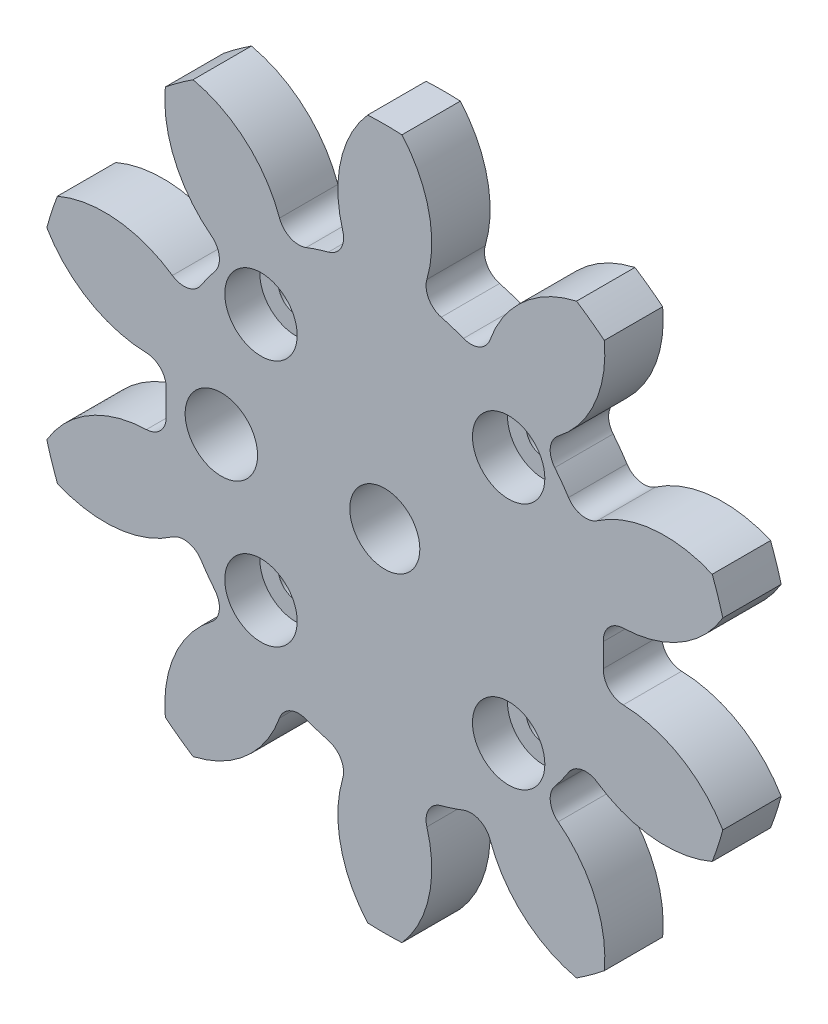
ISO-10303-21;
HEADER;
FILE_DESCRIPTION(('STEP AP214'),'2;1');
FILE_NAME('part.step','',(''),(''),'','','');
FILE_SCHEMA(('AUTOMOTIVE_DESIGN { 1 0 10303 214 1 1 1 1 }'));
ENDSEC;
DATA;
#1=APPLICATION_CONTEXT('core data for automotive mechanical design processes');
#2=APPLICATION_PROTOCOL_DEFINITION('international standard','automotive_design',2000,#1);
#3=PRODUCT_CONTEXT('',#1,'mechanical');
#4=PRODUCT('Part','Part','',(#3));
#5=PRODUCT_RELATED_PRODUCT_CATEGORY('part','',(#4));
#6=PRODUCT_DEFINITION_FORMATION('','',#4);
#7=PRODUCT_DEFINITION_CONTEXT('part definition',#1,'design');
#8=PRODUCT_DEFINITION('design','',#6,#7);
#9=PRODUCT_DEFINITION_SHAPE('','',#8);
#10=(LENGTH_UNIT() NAMED_UNIT(*) SI_UNIT(.MILLI.,.METRE.));
#11=(NAMED_UNIT(*) PLANE_ANGLE_UNIT() SI_UNIT($,.RADIAN.));
#12=(NAMED_UNIT(*) SI_UNIT($,.STERADIAN.) SOLID_ANGLE_UNIT());
#13=UNCERTAINTY_MEASURE_WITH_UNIT(LENGTH_MEASURE(1.E-05),#10,'distance_accuracy_value','');
#14=(GEOMETRIC_REPRESENTATION_CONTEXT(3) GLOBAL_UNCERTAINTY_ASSIGNED_CONTEXT((#13)) GLOBAL_UNIT_ASSIGNED_CONTEXT((#10,
#11,#12)) REPRESENTATION_CONTEXT('',''));
#15=CARTESIAN_POINT('',(0.,0.,0.));
#16=DIRECTION('',(0.,0.,1.));
#17=DIRECTION('',(1.,0.,0.));
#18=AXIS2_PLACEMENT_3D('',#15,#16,#17);
#19=CARTESIAN_POINT('',(10.6066017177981,10.6066017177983,0.));
#20=DIRECTION('',(0.,0.,1.));
#21=DIRECTION('',(1.,0.,0.));
#22=AXIS2_PLACEMENT_3D('',#19,#20,#21);
#23=CYLINDRICAL_SURFACE('',#22,1.5);
#24=CARTESIAN_POINT('',(10.6066017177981,10.6066017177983,0.));
#25=DIRECTION('',(0.,0.,1.));
#26=DIRECTION('',(-1.,0.,0.));
#27=AXIS2_PLACEMENT_3D('',#24,#25,#26);
#28=CIRCLE('',#27,1.5);
#29=CARTESIAN_POINT('',(9.10660171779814,10.6066017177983,0.));
#30=VERTEX_POINT('',#29);
#31=EDGE_CURVE('E901',#30,#30,#28,.T.);
#32=ORIENTED_EDGE('',*,*,#31,.F.);
#33=EDGE_LOOP('',(#32));
#34=FACE_BOUND('',#33,.T.);
#35=CARTESIAN_POINT('',(10.6066017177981,10.6066017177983,2.));
#36=DIRECTION('',(0.,0.,1.));
#37=DIRECTION('',(1.,0.,0.));
#38=AXIS2_PLACEMENT_3D('',#35,#36,#37);
#39=CIRCLE('',#38,1.5);
#40=CARTESIAN_POINT('',(12.1066017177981,10.6066017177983,2.));
#41=VERTEX_POINT('',#40);
#42=EDGE_CURVE('E30',#41,#41,#39,.F.);
#43=ORIENTED_EDGE('',*,*,#42,.F.);
#44=EDGE_LOOP('',(#43));
#45=FACE_BOUND('',#44,.T.);
#46=ADVANCED_FACE('F26',(#34,#45),#23,.F.);
#47=CARTESIAN_POINT('',(10.6066017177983,-10.6066017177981,0.));
#48=DIRECTION('',(0.,0.,1.));
#49=DIRECTION('',(1.,0.,0.));
#50=AXIS2_PLACEMENT_3D('',#47,#48,#49);
#51=CYLINDRICAL_SURFACE('',#50,1.5);
#52=CARTESIAN_POINT('',(10.6066017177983,-10.6066017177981,0.));
#53=DIRECTION('',(0.,0.,1.));
#54=DIRECTION('',(1.,0.,0.));
#55=AXIS2_PLACEMENT_3D('',#52,#53,#54);
#56=CIRCLE('',#55,1.5);
#57=CARTESIAN_POINT('',(12.1066017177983,-10.6066017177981,0.));
#58=VERTEX_POINT('',#57);
#59=EDGE_CURVE('E907',#58,#58,#56,.T.);
#60=ORIENTED_EDGE('',*,*,#59,.F.);
#61=EDGE_LOOP('',(#60));
#62=FACE_BOUND('',#61,.T.);
#63=CARTESIAN_POINT('',(10.6066017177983,-10.6066017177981,2.));
#64=DIRECTION('',(0.,0.,1.));
#65=DIRECTION('',(1.,0.,0.));
#66=AXIS2_PLACEMENT_3D('',#63,#64,#65);
#67=CIRCLE('',#66,1.5);
#68=CARTESIAN_POINT('',(12.1066017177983,-10.6066017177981,2.));
#69=VERTEX_POINT('',#68);
#70=EDGE_CURVE('E873',#69,#69,#67,.F.);
#71=ORIENTED_EDGE('',*,*,#70,.F.);
#72=EDGE_LOOP('',(#71));
#73=FACE_BOUND('',#72,.T.);
#74=ADVANCED_FACE('F980',(#62,#73),#51,.F.);
#75=CARTESIAN_POINT('',(-10.6066017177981,-10.6066017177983,0.));
#76=DIRECTION('',(0.,0.,1.));
#77=DIRECTION('',(1.,0.,0.));
#78=AXIS2_PLACEMENT_3D('',#75,#76,#77);
#79=CYLINDRICAL_SURFACE('',#78,1.5);
#80=CARTESIAN_POINT('',(-10.6066017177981,-10.6066017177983,0.));
#81=DIRECTION('',(0.,0.,1.));
#82=DIRECTION('',(1.,0.,0.));
#83=AXIS2_PLACEMENT_3D('',#80,#81,#82);
#84=CIRCLE('',#83,1.5);
#85=CARTESIAN_POINT('',(-9.10660171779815,-10.6066017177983,0.));
#86=VERTEX_POINT('',#85);
#87=EDGE_CURVE('E904',#86,#86,#84,.T.);
#88=ORIENTED_EDGE('',*,*,#87,.F.);
#89=EDGE_LOOP('',(#88));
#90=FACE_BOUND('',#89,.T.);
#91=CARTESIAN_POINT('',(-10.6066017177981,-10.6066017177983,2.));
#92=DIRECTION('',(0.,0.,1.));
#93=DIRECTION('',(1.,0.,0.));
#94=AXIS2_PLACEMENT_3D('',#91,#92,#93);
#95=CIRCLE('',#94,1.5);
#96=CARTESIAN_POINT('',(-9.10660171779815,-10.6066017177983,2.));
#97=VERTEX_POINT('',#96);
#98=EDGE_CURVE('E869',#97,#97,#95,.F.);
#99=ORIENTED_EDGE('',*,*,#98,.F.);
#100=EDGE_LOOP('',(#99));
#101=FACE_BOUND('',#100,.T.);
#102=ADVANCED_FACE('F987',(#90,#101),#79,.F.);
#103=CARTESIAN_POINT('',(-10.6066017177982,10.6066017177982,0.));
#104=DIRECTION('',(0.,0.,1.));
#105=DIRECTION('',(1.,0.,0.));
#106=AXIS2_PLACEMENT_3D('',#103,#104,#105);
#107=CYLINDRICAL_SURFACE('',#106,1.5);
#108=CARTESIAN_POINT('',(-10.6066017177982,10.6066017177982,0.));
#109=DIRECTION('',(0.,0.,1.));
#110=DIRECTION('',(1.,0.,0.));
#111=AXIS2_PLACEMENT_3D('',#108,#109,#110);
#112=CIRCLE('',#111,1.5);
#113=CARTESIAN_POINT('',(-9.10660171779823,10.6066017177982,0.));
#114=VERTEX_POINT('',#113);
#115=EDGE_CURVE('E909',#114,#114,#112,.T.);
#116=ORIENTED_EDGE('',*,*,#115,.F.);
#117=EDGE_LOOP('',(#116));
#118=FACE_BOUND('',#117,.T.);
#119=CARTESIAN_POINT('',(-10.6066017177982,10.6066017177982,2.));
#120=DIRECTION('',(0.,0.,1.));
#121=DIRECTION('',(1.,0.,0.));
#122=AXIS2_PLACEMENT_3D('',#119,#120,#121);
#123=CIRCLE('',#122,1.5);
#124=CARTESIAN_POINT('',(-9.10660171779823,10.6066017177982,2.));
#125=VERTEX_POINT('',#124);
#126=EDGE_CURVE('E864',#125,#125,#123,.F.);
#127=ORIENTED_EDGE('',*,*,#126,.F.);
#128=EDGE_LOOP('',(#127));
#129=FACE_BOUND('',#128,.T.);
#130=ADVANCED_FACE('F997',(#118,#129),#107,.F.);
#131=CARTESIAN_POINT('',(0.,0.,5.));
#132=DIRECTION('',(0.,0.,-1.));
#133=DIRECTION('',(-1.,0.,0.));
#134=AXIS2_PLACEMENT_3D('',#131,#132,#133);
#135=CYLINDRICAL_SURFACE('',#134,18.75);
#136=CARTESIAN_POINT('',(0.,0.,5.));
#137=DIRECTION('',(0.,0.,1.));
#138=DIRECTION('',(1.,0.,0.));
#139=AXIS2_PLACEMENT_3D('',#136,#137,#138);
#140=CIRCLE('',#139,18.75);
#141=CARTESIAN_POINT('',(6.74042417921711,17.4965477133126,5.));
#142=VERTEX_POINT('',#141);
#143=CARTESIAN_POINT('',(4.83109500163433,18.1169263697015,5.));
#144=VERTEX_POINT('',#143);
#145=EDGE_CURVE('E654',#142,#144,#140,.T.);
#146=ORIENTED_EDGE('',*,*,#145,.F.);
#147=DIRECTION('',(0.,0.,-1.));
#148=VECTOR('',#147,1.);
#149=CARTESIAN_POINT('',(6.74042417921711,17.4965477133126,5.));
#150=LINE('',#149,#148);
#151=CARTESIAN_POINT('',(6.74042417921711,17.4965477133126,0.));
#152=VERTEX_POINT('',#151);
#153=EDGE_CURVE('E698',#142,#152,#150,.T.);
#154=ORIENTED_EDGE('',*,*,#153,.T.);
#155=CARTESIAN_POINT('',(0.,0.,0.));
#156=DIRECTION('',(0.,0.,1.));
#157=DIRECTION('',(1.,0.,0.));
#158=AXIS2_PLACEMENT_3D('',#155,#156,#157);
#159=CIRCLE('',#158,18.75);
#160=CARTESIAN_POINT('',(4.83109500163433,18.1169263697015,0.));
#161=VERTEX_POINT('',#160);
#162=EDGE_CURVE('E642',#152,#161,#159,.T.);
#163=ORIENTED_EDGE('',*,*,#162,.T.);
#164=DIRECTION('',(0.,0.,-1.));
#165=VECTOR('',#164,1.);
#166=CARTESIAN_POINT('',(4.83109500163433,18.1169263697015,5.));
#167=LINE('',#166,#165);
#168=EDGE_CURVE('E674',#161,#144,#167,.F.);
#169=ORIENTED_EDGE('',*,*,#168,.T.);
#170=EDGE_LOOP('',(#146,#154,#163,#169));
#171=FACE_BOUND('',#170,.T.);
#172=ADVANCED_FACE('F28',(#171),#135,.T.);
#173=CARTESIAN_POINT('',(-6.22828729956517,23.1968293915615,5.));
#174=DIRECTION('',(0.,0.,-1.));
#175=DIRECTION('',(-1.,0.,0.));
#176=AXIS2_PLACEMENT_3D('',#173,#174,#175);
#177=CYLINDRICAL_SURFACE('',#176,10.2488291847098);
#178=CARTESIAN_POINT('',(-6.22828729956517,23.1968293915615,5.));
#179=DIRECTION('',(0.,0.,-1.));
#180=DIRECTION('',(-1.,0.,0.));
#181=AXIS2_PLACEMENT_3D('',#178,#179,#180);
#182=CIRCLE('',#181,10.2488291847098);
#183=CARTESIAN_POINT('',(1.46869465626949,29.9640273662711,5.));
#184=VERTEX_POINT('',#183);
#185=CARTESIAN_POINT('',(3.60325025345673,20.3021154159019,5.));
#186=VERTEX_POINT('',#185);
#187=EDGE_CURVE('E656',#184,#186,#182,.T.);
#188=ORIENTED_EDGE('',*,*,#187,.T.);
#189=DIRECTION('',(0.,0.,-1.));
#190=VECTOR('',#189,1.);
#191=CARTESIAN_POINT('',(3.60325025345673,20.3021154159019,5.));
#192=LINE('',#191,#190);
#193=CARTESIAN_POINT('',(3.60325025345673,20.3021154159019,0.));
#194=VERTEX_POINT('',#193);
#195=EDGE_CURVE('E671',#186,#194,#192,.T.);
#196=ORIENTED_EDGE('',*,*,#195,.T.);
#197=CARTESIAN_POINT('',(-6.22828729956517,23.1968293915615,0.));
#198=DIRECTION('',(0.,0.,-1.));
#199=DIRECTION('',(-1.,0.,0.));
#200=AXIS2_PLACEMENT_3D('',#197,#198,#199);
#201=CIRCLE('',#200,10.2488291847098);
#202=CARTESIAN_POINT('',(1.46869465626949,29.9640273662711,0.));
#203=VERTEX_POINT('',#202);
#204=EDGE_CURVE('E644',#203,#194,#201,.T.);
#205=ORIENTED_EDGE('',*,*,#204,.F.);
#206=DIRECTION('',(0.,0.,-1.));
#207=VECTOR('',#206,1.);
#208=CARTESIAN_POINT('',(1.46869465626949,29.9640273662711,5.));
#209=LINE('',#208,#207);
#210=EDGE_CURVE('E669',#184,#203,#209,.T.);
#211=ORIENTED_EDGE('',*,*,#210,.F.);
#212=EDGE_LOOP('',(#188,#196,#205,#211));
#213=FACE_BOUND('',#212,.T.);
#214=ADVANCED_FACE('F947',(#213),#177,.T.);
#215=CARTESIAN_POINT('',(0.,0.,5.));
#216=DIRECTION('',(0.,0.,-1.));
#217=DIRECTION('',(-1.,0.,0.));
#218=AXIS2_PLACEMENT_3D('',#215,#216,#217);
#219=CYLINDRICAL_SURFACE('',#218,30.);
#220=CARTESIAN_POINT('',(0.,0.,0.));
#221=DIRECTION('',(0.,0.,1.));
#222=DIRECTION('',(1.,0.,0.));
#223=AXIS2_PLACEMENT_3D('',#220,#221,#222);
#224=CIRCLE('',#223,30.);
#225=CARTESIAN_POINT('',(-1.46869465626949,29.9640273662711,0.));
#226=VERTEX_POINT('',#225);
#227=EDGE_CURVE('E647',#203,#226,#224,.T.);
#228=ORIENTED_EDGE('',*,*,#227,.T.);
#229=DIRECTION('',(0.,0.,-1.));
#230=VECTOR('',#229,1.);
#231=CARTESIAN_POINT('',(-1.46869465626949,29.9640273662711,5.));
#232=LINE('',#231,#230);
#233=CARTESIAN_POINT('',(-1.46869465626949,29.9640273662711,5.));
#234=VERTEX_POINT('',#233);
#235=EDGE_CURVE('E666',#234,#226,#232,.T.);
#236=ORIENTED_EDGE('',*,*,#235,.F.);
#237=CARTESIAN_POINT('',(0.,0.,5.));
#238=DIRECTION('',(0.,0.,1.));
#239=DIRECTION('',(1.,0.,0.));
#240=AXIS2_PLACEMENT_3D('',#237,#238,#239);
#241=CIRCLE('',#240,30.);
#242=EDGE_CURVE('E659',#184,#234,#241,.T.);
#243=ORIENTED_EDGE('',*,*,#242,.F.);
#244=ORIENTED_EDGE('',*,*,#210,.T.);
#245=EDGE_LOOP('',(#228,#236,#243,#244));
#246=FACE_BOUND('',#245,.T.);
#247=ADVANCED_FACE('F951',(#246),#219,.T.);
#248=CARTESIAN_POINT('',(6.22828729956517,23.1968293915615,5.));
#249=DIRECTION('',(0.,0.,-1.));
#250=DIRECTION('',(-1.,0.,0.));
#251=AXIS2_PLACEMENT_3D('',#248,#249,#250);
#252=CYLINDRICAL_SURFACE('',#251,10.2488291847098);
#253=CARTESIAN_POINT('',(6.22828729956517,23.1968293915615,0.));
#254=DIRECTION('',(0.,0.,1.));
#255=DIRECTION('',(1.,0.,0.));
#256=AXIS2_PLACEMENT_3D('',#253,#254,#255);
#257=CIRCLE('',#256,10.2488291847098);
#258=CARTESIAN_POINT('',(-3.60325025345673,20.3021154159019,0.));
#259=VERTEX_POINT('',#258);
#260=EDGE_CURVE('E649',#226,#259,#257,.T.);
#261=ORIENTED_EDGE('',*,*,#260,.T.);
#262=DIRECTION('',(0.,0.,-1.));
#263=VECTOR('',#262,1.);
#264=CARTESIAN_POINT('',(-3.60325025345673,20.3021154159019,5.));
#265=LINE('',#264,#263);
#266=CARTESIAN_POINT('',(-3.60325025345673,20.3021154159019,5.));
#267=VERTEX_POINT('',#266);
#268=EDGE_CURVE('E680',#259,#267,#265,.F.);
#269=ORIENTED_EDGE('',*,*,#268,.T.);
#270=CARTESIAN_POINT('',(6.22828729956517,23.1968293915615,5.));
#271=DIRECTION('',(0.,0.,1.));
#272=DIRECTION('',(1.,0.,0.));
#273=AXIS2_PLACEMENT_3D('',#270,#271,#272);
#274=CIRCLE('',#273,10.2488291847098);
#275=EDGE_CURVE('E661',#234,#267,#274,.T.);
#276=ORIENTED_EDGE('',*,*,#275,.F.);
#277=ORIENTED_EDGE('',*,*,#235,.T.);
#278=EDGE_LOOP('',(#261,#269,#276,#277));
#279=FACE_BOUND('',#278,.T.);
#280=ADVANCED_FACE('F968',(#279),#252,.T.);
#281=CARTESIAN_POINT('',(0.,0.,5.));
#282=DIRECTION('',(0.,0.,-1.));
#283=DIRECTION('',(-1.,0.,0.));
#284=AXIS2_PLACEMENT_3D('',#281,#282,#283);
#285=CYLINDRICAL_SURFACE('',#284,18.75);
#286=CARTESIAN_POINT('',(0.,0.,0.));
#287=DIRECTION('',(0.,0.,-1.));
#288=DIRECTION('',(-1.,0.,0.));
#289=AXIS2_PLACEMENT_3D('',#286,#287,#288);
#290=CIRCLE('',#289,18.75);
#291=CARTESIAN_POINT('',(-6.74042417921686,17.4965477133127,0.));
#292=VERTEX_POINT('',#291);
#293=CARTESIAN_POINT('',(-4.83109500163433,18.1169263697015,0.));
#294=VERTEX_POINT('',#293);
#295=EDGE_CURVE('E652',#292,#294,#290,.T.);
#296=ORIENTED_EDGE('',*,*,#295,.F.);
#297=DIRECTION('',(0.,0.,-1.));
#298=VECTOR('',#297,1.);
#299=CARTESIAN_POINT('',(-6.74042417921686,17.4965477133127,5.));
#300=LINE('',#299,#298);
#301=CARTESIAN_POINT('',(-6.74042417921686,17.4965477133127,5.));
#302=VERTEX_POINT('',#301);
#303=EDGE_CURVE('E853',#292,#302,#300,.F.);
#304=ORIENTED_EDGE('',*,*,#303,.T.);
#305=CARTESIAN_POINT('',(0.,0.,5.));
#306=DIRECTION('',(0.,0.,-1.));
#307=DIRECTION('',(-1.,0.,0.));
#308=AXIS2_PLACEMENT_3D('',#305,#306,#307);
#309=CIRCLE('',#308,18.75);
#310=CARTESIAN_POINT('',(-4.83109500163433,18.1169263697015,5.));
#311=VERTEX_POINT('',#310);
#312=EDGE_CURVE('E664',#302,#311,#309,.T.);
#313=ORIENTED_EDGE('',*,*,#312,.T.);
#314=DIRECTION('',(0.,0.,-1.));
#315=VECTOR('',#314,1.);
#316=CARTESIAN_POINT('',(-4.83109500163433,18.1169263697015,5.));
#317=LINE('',#316,#315);
#318=EDGE_CURVE('E677',#311,#294,#317,.T.);
#319=ORIENTED_EDGE('',*,*,#318,.T.);
#320=EDGE_LOOP('',(#296,#304,#313,#319));
#321=FACE_BOUND('',#320,.T.);
#322=ADVANCED_FACE('F922',(#321),#285,.T.);
#323=CARTESIAN_POINT('',(0.,0.,5.));
#324=DIRECTION('',(0.,0.,1.));
#325=DIRECTION('',(1.,0.,0.));
#326=AXIS2_PLACEMENT_3D('',#323,#324,#325);
#327=PLANE('',#326);
#328=CARTESIAN_POINT('',(10.6066017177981,10.6066017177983,5.));
#329=DIRECTION('',(0.,0.,1.));
#330=DIRECTION('',(1.,0.,0.));
#331=AXIS2_PLACEMENT_3D('',#328,#329,#330);
#332=CIRCLE('',#331,3.1);
#333=CARTESIAN_POINT('',(13.7066017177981,10.6066017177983,5.));
#334=VERTEX_POINT('',#333);
#335=EDGE_CURVE('E1327',#334,#334,#332,.T.);
#336=ORIENTED_EDGE('',*,*,#335,.F.);
#337=EDGE_LOOP('',(#336));
#338=FACE_BOUND('',#337,.T.);
#339=CARTESIAN_POINT('',(10.6066017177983,-10.6066017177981,5.));
#340=DIRECTION('',(0.,0.,1.));
#341=DIRECTION('',(1.,0.,0.));
#342=AXIS2_PLACEMENT_3D('',#339,#340,#341);
#343=CIRCLE('',#342,3.1);
#344=CARTESIAN_POINT('',(13.7066017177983,-10.6066017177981,5.));
#345=VERTEX_POINT('',#344);
#346=EDGE_CURVE('E882',#345,#345,#343,.T.);
#347=ORIENTED_EDGE('',*,*,#346,.F.);
#348=EDGE_LOOP('',(#347));
#349=FACE_BOUND('',#348,.T.);
#350=CARTESIAN_POINT('',(-10.6066017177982,-10.6066017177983,5.));
#351=DIRECTION('',(0.,0.,1.));
#352=DIRECTION('',(1.,0.,0.));
#353=AXIS2_PLACEMENT_3D('',#350,#351,#352);
#354=CIRCLE('',#353,3.1);
#355=CARTESIAN_POINT('',(-7.50660171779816,-10.6066017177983,5.));
#356=VERTEX_POINT('',#355);
#357=EDGE_CURVE('E875',#356,#356,#354,.T.);
#358=ORIENTED_EDGE('',*,*,#357,.F.);
#359=EDGE_LOOP('',(#358));
#360=FACE_BOUND('',#359,.T.);
#361=CARTESIAN_POINT('',(-10.6066017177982,10.6066017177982,5.));
#362=DIRECTION('',(0.,0.,1.));
#363=DIRECTION('',(1.,0.,0.));
#364=AXIS2_PLACEMENT_3D('',#361,#362,#363);
#365=CIRCLE('',#364,3.1);
#366=CARTESIAN_POINT('',(-7.50660171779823,10.6066017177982,5.));
#367=VERTEX_POINT('',#366);
#368=EDGE_CURVE('E871',#367,#367,#365,.T.);
#369=ORIENTED_EDGE('',*,*,#368,.F.);
#370=EDGE_LOOP('',(#369));
#371=FACE_BOUND('',#370,.T.);
#372=CARTESIAN_POINT('',(-14.,0.,5.));
#373=DIRECTION('',(0.,0.,1.));
#374=DIRECTION('',(1.,0.,0.));
#375=AXIS2_PLACEMENT_3D('',#372,#373,#374);
#376=CIRCLE('',#375,3.1);
#377=CARTESIAN_POINT('',(-10.9,0.,5.));
#378=VERTEX_POINT('',#377);
#379=EDGE_CURVE('E867',#378,#378,#376,.T.);
#380=ORIENTED_EDGE('',*,*,#379,.F.);
#381=EDGE_LOOP('',(#380));
#382=FACE_BOUND('',#381,.T.);
#383=CARTESIAN_POINT('',(0.,0.,5.));
#384=DIRECTION('',(0.,0.,1.));
#385=DIRECTION('',(1.,0.,0.));
#386=AXIS2_PLACEMENT_3D('',#383,#384,#385);
#387=CIRCLE('',#386,3.);
#388=CARTESIAN_POINT('',(3.,0.,5.));
#389=VERTEX_POINT('',#388);
#390=EDGE_CURVE('E431',#389,#389,#387,.T.);
#391=ORIENTED_EDGE('',*,*,#390,.F.);
#392=EDGE_LOOP('',(#391));
#393=FACE_BOUND('',#392,.T.);
#394=CARTESIAN_POINT('',(18.6735444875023,15.1057337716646,5.));
#395=DIRECTION('',(0.,0.,1.));
#396=DIRECTION('',(0.809016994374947,-0.587785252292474,0.));
#397=AXIS2_PLACEMENT_3D('',#394,#395,#396);
#398=CIRCLE('',#397,10.2488291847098);
#399=CARTESIAN_POINT('',(16.4242144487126,25.1046844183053,5.));
#400=VERTEX_POINT('',#399);
#401=CARTESIAN_POINT('',(9.01819334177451,18.5426937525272,5.));
#402=VERTEX_POINT('',#401);
#403=EDGE_CURVE('E634',#400,#402,#398,.T.);
#404=ORIENTED_EDGE('',*,*,#403,.T.);
#405=CARTESIAN_POINT('',(7.36953043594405,19.1295588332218,5.));
#406=DIRECTION('',(0.,0.,1.));
#407=DIRECTION('',(1.,0.,0.));
#408=AXIS2_PLACEMENT_3D('',#405,#406,#407);
#409=CIRCLE('',#408,1.75);
#410=EDGE_CURVE('E710',#402,#142,#409,.F.);
#411=ORIENTED_EDGE('',*,*,#410,.T.);
#412=ORIENTED_EDGE('',*,*,#145,.T.);
#413=CARTESIAN_POINT('',(5.28199720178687,19.8078394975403,5.));
#414=DIRECTION('',(0.,0.,1.));
#415=DIRECTION('',(1.,0.,0.));
#416=AXIS2_PLACEMENT_3D('',#413,#414,#415);
#417=CIRCLE('',#416,1.75);
#418=EDGE_CURVE('E685',#144,#186,#417,.F.);
#419=ORIENTED_EDGE('',*,*,#418,.T.);
#420=ORIENTED_EDGE('',*,*,#187,.F.);
#421=ORIENTED_EDGE('',*,*,#242,.T.);
#422=ORIENTED_EDGE('',*,*,#275,.T.);
#423=CARTESIAN_POINT('',(-5.28199720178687,19.8078394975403,5.));
#424=DIRECTION('',(0.,0.,1.));
#425=DIRECTION('',(1.,0.,0.));
#426=AXIS2_PLACEMENT_3D('',#423,#424,#425);
#427=CIRCLE('',#426,1.75);
#428=EDGE_CURVE('E689',#267,#311,#427,.F.);
#429=ORIENTED_EDGE('',*,*,#428,.T.);
#430=ORIENTED_EDGE('',*,*,#312,.F.);
#431=CARTESIAN_POINT('',(-7.36953043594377,19.1295588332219,5.));
#432=DIRECTION('',(0.,0.,1.));
#433=DIRECTION('',(1.,0.,0.));
#434=AXIS2_PLACEMENT_3D('',#431,#432,#433);
#435=CIRCLE('',#434,1.75);
#436=CARTESIAN_POINT('',(-9.01819334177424,18.5426937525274,5.));
#437=VERTEX_POINT('',#436);
#438=EDGE_CURVE('E861',#302,#437,#435,.F.);
#439=ORIENTED_EDGE('',*,*,#438,.T.);
#440=CARTESIAN_POINT('',(-18.6735444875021,15.1057337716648,5.));
#441=DIRECTION('',(0.,0.,-1.));
#442=DIRECTION('',(-0.809016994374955,-0.587785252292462,0.));
#443=AXIS2_PLACEMENT_3D('',#440,#441,#442);
#444=CIRCLE('',#443,10.2488291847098);
#445=CARTESIAN_POINT('',(-16.4242144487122,25.1046844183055,5.));
#446=VERTEX_POINT('',#445);
#447=EDGE_CURVE('E437',#446,#437,#444,.T.);
#448=ORIENTED_EDGE('',*,*,#447,.F.);
#449=CARTESIAN_POINT('',(0.,0.,5.));
#450=DIRECTION('',(0.,0.,1.));
#451=DIRECTION('',(0.809016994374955,0.587785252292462,0.));
#452=AXIS2_PLACEMENT_3D('',#449,#450,#451);
#453=CIRCLE('',#452,30.);
#454=CARTESIAN_POINT('',(-18.8006123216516,23.3781303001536,5.));
#455=VERTEX_POINT('',#454);
#456=EDGE_CURVE('E410',#446,#455,#453,.T.);
#457=ORIENTED_EDGE('',*,*,#456,.T.);
#458=CARTESIAN_POINT('',(-8.59596394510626,22.4275246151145,5.));
#459=DIRECTION('',(0.,0.,1.));
#460=DIRECTION('',(0.809016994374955,0.587785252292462,0.));
#461=AXIS2_PLACEMENT_3D('',#458,#459,#460);
#462=CIRCLE('',#461,10.2488291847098);
#463=CARTESIAN_POINT('',(-14.848374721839,14.3068190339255,5.));
#464=VERTEX_POINT('',#463);
#465=EDGE_CURVE('E440',#455,#464,#462,.T.);
#466=ORIENTED_EDGE('',*,*,#465,.T.);
#467=CARTESIAN_POINT('',(-15.9159814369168,12.9201987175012,5.));
#468=DIRECTION('',(0.,0.,1.));
#469=DIRECTION('',(1.,0.,0.));
#470=AXIS2_PLACEMENT_3D('',#467,#468,#469);
#471=CIRCLE('',#470,1.75);
#472=CARTESIAN_POINT('',(-14.557300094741,11.8172549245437,5.));
#473=VERTEX_POINT('',#472);
#474=EDGE_CURVE('E11',#464,#473,#471,.F.);
#475=ORIENTED_EDGE('',*,*,#474,.T.);
#476=CARTESIAN_POINT('',(0.,0.,5.));
#477=DIRECTION('',(0.,0.,1.));
#478=DIRECTION('',(0.309016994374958,0.95105651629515,0.));
#479=AXIS2_PLACEMENT_3D('',#476,#477,#478);
#480=CIRCLE('',#479,18.75);
#481=CARTESIAN_POINT('',(-15.7373304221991,10.1930825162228,5.));
#482=VERTEX_POINT('',#481);
#483=EDGE_CURVE('E452',#473,#482,#480,.T.);
#484=ORIENTED_EDGE('',*,*,#483,.T.);
#485=CARTESIAN_POINT('',(-17.206147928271,11.1444368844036,5.));
#486=DIRECTION('',(0.,0.,1.));
#487=DIRECTION('',(1.,0.,0.));
#488=AXIS2_PLACEMENT_3D('',#485,#486,#487);
#489=CIRCLE('',#488,1.75);
#490=CARTESIAN_POINT('',(-18.1949935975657,9.70059331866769,5.));
#491=VERTEX_POINT('',#490);
#492=EDGE_CURVE('E846',#482,#491,#489,.F.);
#493=ORIENTED_EDGE('',*,*,#492,.T.);
#494=CARTESIAN_POINT('',(-23.9861423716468,1.24476127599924,5.));
#495=DIRECTION('',(0.,0.,-1.));
#496=DIRECTION('',(-0.309016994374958,-0.95105651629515,0.));
#497=AXIS2_PLACEMENT_3D('',#494,#495,#496);
#498=CIRCLE('',#497,10.2488291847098);
#499=CARTESIAN_POINT('',(-28.0436318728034,10.6562052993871,5.));
#500=VERTEX_POINT('',#499);
#501=EDGE_CURVE('E454',#500,#491,#498,.T.);
#502=ORIENTED_EDGE('',*,*,#501,.F.);
#503=CARTESIAN_POINT('',(0.,0.,5.));
#504=DIRECTION('',(0.,0.,1.));
#505=DIRECTION('',(0.309016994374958,0.95105651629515,0.));
#506=AXIS2_PLACEMENT_3D('',#503,#504,#505);
#507=CIRCLE('',#506,30.);
#508=CARTESIAN_POINT('',(-28.9513350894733,7.86258205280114,5.));
#509=VERTEX_POINT('',#508);
#510=EDGE_CURVE('E457',#500,#509,#507,.T.);
#511=ORIENTED_EDGE('',*,*,#510,.T.);
#512=CARTESIAN_POINT('',(-20.1368491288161,13.0916677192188,5.));
#513=DIRECTION('',(0.,0.,1.));
#514=DIRECTION('',(0.309016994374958,0.95105651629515,0.));
#515=AXIS2_PLACEMENT_3D('',#512,#513,#514);
#516=CIRCLE('',#515,10.2488291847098);
#517=CARTESIAN_POINT('',(-20.4219247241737,2.84680405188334,5.));
#518=VERTEX_POINT('',#517);
#519=EDGE_CURVE('E459',#509,#518,#516,.T.);
#520=ORIENTED_EDGE('',*,*,#519,.T.);
#521=CARTESIAN_POINT('',(-20.4706017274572,1.09748116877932,5.));
#522=DIRECTION('',(0.,0.,1.));
#523=DIRECTION('',(1.,0.,0.));
#524=AXIS2_PLACEMENT_3D('',#521,#522,#523);
#525=CIRCLE('',#524,1.75);
#526=CARTESIAN_POINT('',(-18.7231113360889,1.00379375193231,5.));
#527=VERTEX_POINT('',#526);
#528=EDGE_CURVE('E850',#518,#527,#525,.F.);
#529=ORIENTED_EDGE('',*,*,#528,.T.);
#530=CARTESIAN_POINT('',(0.,0.,5.));
#531=DIRECTION('',(0.,0.,1.));
#532=DIRECTION('',(-0.309016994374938,0.951056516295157,0.));
#533=AXIS2_PLACEMENT_3D('',#530,#531,#532);
#534=CIRCLE('',#533,18.75);
#535=CARTESIAN_POINT('',(-18.7231113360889,-1.00379375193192,5.));
#536=VERTEX_POINT('',#535);
#537=EDGE_CURVE('E477',#527,#536,#534,.T.);
#538=ORIENTED_EDGE('',*,*,#537,.T.);
#539=CARTESIAN_POINT('',(-20.4706017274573,-1.0974811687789,5.));
#540=DIRECTION('',(0.,0.,1.));
#541=DIRECTION('',(1.,0.,0.));
#542=AXIS2_PLACEMENT_3D('',#539,#540,#541);
#543=CIRCLE('',#542,1.75);
#544=CARTESIAN_POINT('',(-20.4219247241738,-2.84680405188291,5.));
#545=VERTEX_POINT('',#544);
#546=EDGE_CURVE('E826',#536,#545,#543,.F.);
#547=ORIENTED_EDGE('',*,*,#546,.T.);
#548=CARTESIAN_POINT('',(-20.1368491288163,-13.0916677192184,5.));
#549=DIRECTION('',(0.,0.,-1.));
#550=DIRECTION('',(0.309016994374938,-0.951056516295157,0.));
#551=AXIS2_PLACEMENT_3D('',#548,#549,#550);
#552=CIRCLE('',#551,10.2488291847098);
#553=CARTESIAN_POINT('',(-28.9513350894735,-7.86258205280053,5.));
#554=VERTEX_POINT('',#553);
#555=EDGE_CURVE('E479',#554,#545,#552,.T.);
#556=ORIENTED_EDGE('',*,*,#555,.F.);
#557=CARTESIAN_POINT('',(0.,0.,5.));
#558=DIRECTION('',(0.,0.,1.));
#559=DIRECTION('',(-0.309016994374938,0.951056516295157,0.));
#560=AXIS2_PLACEMENT_3D('',#557,#558,#559);
#561=CIRCLE('',#560,30.);
#562=CARTESIAN_POINT('',(-28.0436318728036,-10.6562052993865,5.));
#563=VERTEX_POINT('',#562);
#564=EDGE_CURVE('E482',#554,#563,#561,.T.);
#565=ORIENTED_EDGE('',*,*,#564,.T.);
#566=CARTESIAN_POINT('',(-23.9861423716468,-1.24476127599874,5.));
#567=DIRECTION('',(0.,0.,1.));
#568=DIRECTION('',(-0.309016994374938,0.951056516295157,0.));
#569=AXIS2_PLACEMENT_3D('',#566,#567,#568);
#570=CIRCLE('',#569,10.2488291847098);
#571=CARTESIAN_POINT('',(-18.1949935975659,-9.70059331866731,5.));
#572=VERTEX_POINT('',#571);
#573=EDGE_CURVE('E484',#563,#572,#570,.T.);
#574=ORIENTED_EDGE('',*,*,#573,.T.);
#575=CARTESIAN_POINT('',(-17.2061479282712,-11.1444368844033,5.));
#576=DIRECTION('',(0.,0.,1.));
#577=DIRECTION('',(1.,0.,0.));
#578=AXIS2_PLACEMENT_3D('',#575,#576,#577);
#579=CIRCLE('',#578,1.75);
#580=CARTESIAN_POINT('',(-15.7373304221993,-10.1930825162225,5.));
#581=VERTEX_POINT('',#580);
#582=EDGE_CURVE('E830',#572,#581,#579,.F.);
#583=ORIENTED_EDGE('',*,*,#582,.T.);
#584=CARTESIAN_POINT('',(0.,0.,5.));
#585=DIRECTION('',(0.,0.,1.));
#586=DIRECTION('',(-0.809016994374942,0.58778525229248,0.));
#587=AXIS2_PLACEMENT_3D('',#584,#585,#586);
#588=CIRCLE('',#587,18.75);
#589=CARTESIAN_POINT('',(-14.5573000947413,-11.8172549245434,5.));
#590=VERTEX_POINT('',#589);
#591=EDGE_CURVE('E502',#581,#590,#588,.T.);
#592=ORIENTED_EDGE('',*,*,#591,.T.);
#593=CARTESIAN_POINT('',(-15.9159814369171,-12.9201987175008,5.));
#594=DIRECTION('',(0.,0.,1.));
#595=DIRECTION('',(1.,0.,0.));
#596=AXIS2_PLACEMENT_3D('',#593,#594,#595);
#597=CIRCLE('',#596,1.75);
#598=CARTESIAN_POINT('',(-14.8483747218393,-14.3068190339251,5.));
#599=VERTEX_POINT('',#598);
#600=EDGE_CURVE('E806',#590,#599,#597,.F.);
#601=ORIENTED_EDGE('',*,*,#600,.T.);
#602=CARTESIAN_POINT('',(-8.59596394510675,-22.4275246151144,5.));
#603=DIRECTION('',(0.,0.,-1.));
#604=DIRECTION('',(0.809016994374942,-0.58778525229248,0.));
#605=AXIS2_PLACEMENT_3D('',#602,#603,#604);
#606=CIRCLE('',#605,10.2488291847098);
#607=CARTESIAN_POINT('',(-18.8006123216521,-23.3781303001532,5.));
#608=VERTEX_POINT('',#607);
#609=EDGE_CURVE('E504',#608,#599,#606,.T.);
#610=ORIENTED_EDGE('',*,*,#609,.F.);
#611=CARTESIAN_POINT('',(0.,0.,5.));
#612=DIRECTION('',(0.,0.,1.));
#613=DIRECTION('',(-0.809016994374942,0.58778525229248,0.));
#614=AXIS2_PLACEMENT_3D('',#611,#612,#613);
#615=CIRCLE('',#614,30.);
#616=CARTESIAN_POINT('',(-16.4242144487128,-25.1046844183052,5.));
#617=VERTEX_POINT('',#616);
#618=EDGE_CURVE('E507',#608,#617,#615,.T.);
#619=ORIENTED_EDGE('',*,*,#618,.T.);
#620=CARTESIAN_POINT('',(-18.6735444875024,-15.1057337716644,5.));
#621=DIRECTION('',(0.,0.,1.));
#622=DIRECTION('',(-0.809016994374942,0.58778525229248,0.));
#623=AXIS2_PLACEMENT_3D('',#620,#621,#622);
#624=CIRCLE('',#623,10.2488291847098);
#625=CARTESIAN_POINT('',(-9.01819334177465,-18.5426937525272,5.));
#626=VERTEX_POINT('',#625);
#627=EDGE_CURVE('E509',#617,#626,#624,.T.);
#628=ORIENTED_EDGE('',*,*,#627,.T.);
#629=CARTESIAN_POINT('',(-7.36953043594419,-19.1295588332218,5.));
#630=DIRECTION('',(0.,0.,1.));
#631=DIRECTION('',(1.,0.,0.));
#632=AXIS2_PLACEMENT_3D('',#629,#630,#631);
#633=CIRCLE('',#632,1.75);
#634=CARTESIAN_POINT('',(-6.74042417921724,-17.4965477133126,5.));
#635=VERTEX_POINT('',#634);
#636=EDGE_CURVE('E810',#626,#635,#633,.F.);
#637=ORIENTED_EDGE('',*,*,#636,.T.);
#638=CARTESIAN_POINT('',(0.,0.,5.));
#639=DIRECTION('',(0.,0.,1.));
#640=DIRECTION('',(-1.,0.,0.));
#641=AXIS2_PLACEMENT_3D('',#638,#639,#640);
#642=CIRCLE('',#641,18.75);
#643=CARTESIAN_POINT('',(-4.83109500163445,-18.1169263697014,5.));
#644=VERTEX_POINT('',#643);
#645=EDGE_CURVE('E527',#635,#644,#642,.T.);
#646=ORIENTED_EDGE('',*,*,#645,.T.);
#647=CARTESIAN_POINT('',(-5.281997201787,-19.8078394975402,5.));
#648=DIRECTION('',(0.,0.,1.));
#649=DIRECTION('',(1.,0.,0.));
#650=AXIS2_PLACEMENT_3D('',#647,#648,#649);
#651=CIRCLE('',#650,1.75);
#652=CARTESIAN_POINT('',(-3.60325025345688,-20.3021154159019,5.));
#653=VERTEX_POINT('',#652);
#654=EDGE_CURVE('E786',#644,#653,#651,.F.);
#655=ORIENTED_EDGE('',*,*,#654,.T.);
#656=CARTESIAN_POINT('',(6.22828729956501,-23.1968293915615,5.));
#657=DIRECTION('',(0.,0.,-1.));
#658=DIRECTION('',(1.,0.,0.));
#659=AXIS2_PLACEMENT_3D('',#656,#657,#658);
#660=CIRCLE('',#659,10.2488291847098);
#661=CARTESIAN_POINT('',(-1.4686946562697,-29.9640273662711,5.));
#662=VERTEX_POINT('',#661);
#663=EDGE_CURVE('E529',#662,#653,#660,.T.);
#664=ORIENTED_EDGE('',*,*,#663,.F.);
#665=CARTESIAN_POINT('',(0.,0.,5.));
#666=DIRECTION('',(0.,0.,1.));
#667=DIRECTION('',(-1.,0.,0.));
#668=AXIS2_PLACEMENT_3D('',#665,#666,#667);
#669=CIRCLE('',#668,30.);
#670=CARTESIAN_POINT('',(1.46869465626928,-29.9640273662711,5.));
#671=VERTEX_POINT('',#670);
#672=EDGE_CURVE('E532',#662,#671,#669,.T.);
#673=ORIENTED_EDGE('',*,*,#672,.T.);
#674=CARTESIAN_POINT('',(-6.22828729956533,-23.1968293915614,5.));
#675=DIRECTION('',(0.,0.,1.));
#676=DIRECTION('',(-1.,0.,0.));
#677=AXIS2_PLACEMENT_3D('',#674,#675,#676);
#678=CIRCLE('',#677,10.2488291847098);
#679=CARTESIAN_POINT('',(3.60325025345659,-20.3021154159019,5.));
#680=VERTEX_POINT('',#679);
#681=EDGE_CURVE('E534',#671,#680,#678,.T.);
#682=ORIENTED_EDGE('',*,*,#681,.T.);
#683=CARTESIAN_POINT('',(5.28199720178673,-19.8078394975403,5.));
#684=DIRECTION('',(0.,0.,1.));
#685=DIRECTION('',(1.,0.,0.));
#686=AXIS2_PLACEMENT_3D('',#683,#684,#685);
#687=CIRCLE('',#686,1.75);
#688=CARTESIAN_POINT('',(4.8310950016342,-18.1169263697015,5.));
#689=VERTEX_POINT('',#688);
#690=EDGE_CURVE('E790',#680,#689,#687,.F.);
#691=ORIENTED_EDGE('',*,*,#690,.T.);
#692=CARTESIAN_POINT('',(0.,0.,5.));
#693=DIRECTION('',(0.,0.,1.));
#694=DIRECTION('',(-0.809016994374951,-0.587785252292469,0.));
#695=AXIS2_PLACEMENT_3D('',#692,#693,#694);
#696=CIRCLE('',#695,18.75);
#697=CARTESIAN_POINT('',(6.74042417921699,-17.4965477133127,5.));
#698=VERTEX_POINT('',#697);
#699=EDGE_CURVE('E552',#689,#698,#696,.T.);
#700=ORIENTED_EDGE('',*,*,#699,.T.);
#701=CARTESIAN_POINT('',(7.36953043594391,-19.1295588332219,5.));
#702=DIRECTION('',(0.,0.,1.));
#703=DIRECTION('',(1.,0.,0.));
#704=AXIS2_PLACEMENT_3D('',#701,#702,#703);
#705=CIRCLE('',#704,1.75);
#706=CARTESIAN_POINT('',(9.01819334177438,-18.5426937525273,5.));
#707=VERTEX_POINT('',#706);
#708=EDGE_CURVE('E766',#698,#707,#705,.F.);
#709=ORIENTED_EDGE('',*,*,#708,.T.);
#710=CARTESIAN_POINT('',(18.6735444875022,-15.1057337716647,5.));
#711=DIRECTION('',(0.,0.,-1.));
#712=DIRECTION('',(0.809016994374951,0.587785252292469,0.));
#713=AXIS2_PLACEMENT_3D('',#710,#711,#712);
#714=CIRCLE('',#713,10.2488291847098);
#715=CARTESIAN_POINT('',(16.4242144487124,-25.1046844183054,5.));
#716=VERTEX_POINT('',#715);
#717=EDGE_CURVE('E554',#716,#707,#714,.T.);
#718=ORIENTED_EDGE('',*,*,#717,.F.);
#719=CARTESIAN_POINT('',(0.,0.,5.));
#720=DIRECTION('',(0.,0.,1.));
#721=DIRECTION('',(-0.809016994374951,-0.587785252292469,0.));
#722=AXIS2_PLACEMENT_3D('',#719,#720,#721);
#723=CIRCLE('',#722,30.);
#724=CARTESIAN_POINT('',(18.8006123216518,-23.3781303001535,5.));
#725=VERTEX_POINT('',#724);
#726=EDGE_CURVE('E557',#716,#725,#723,.T.);
#727=ORIENTED_EDGE('',*,*,#726,.T.);
#728=CARTESIAN_POINT('',(8.59596394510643,-22.4275246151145,5.));
#729=DIRECTION('',(0.,0.,1.));
#730=DIRECTION('',(-0.809016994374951,-0.587785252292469,0.));
#731=AXIS2_PLACEMENT_3D('',#728,#729,#730);
#732=CIRCLE('',#731,10.2488291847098);
#733=CARTESIAN_POINT('',(14.8483747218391,-14.3068190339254,5.));
#734=VERTEX_POINT('',#733);
#735=EDGE_CURVE('E559',#725,#734,#732,.T.);
#736=ORIENTED_EDGE('',*,*,#735,.T.);
#737=CARTESIAN_POINT('',(15.9159814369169,-12.920198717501,5.));
#738=DIRECTION('',(0.,0.,1.));
#739=DIRECTION('',(1.,0.,0.));
#740=AXIS2_PLACEMENT_3D('',#737,#738,#739);
#741=CIRCLE('',#740,1.75);
#742=CARTESIAN_POINT('',(14.5573000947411,-11.8172549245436,5.));
#743=VERTEX_POINT('',#742);
#744=EDGE_CURVE('E770',#734,#743,#741,.F.);
#745=ORIENTED_EDGE('',*,*,#744,.T.);
#746=CARTESIAN_POINT('',(0.,0.,5.));
#747=DIRECTION('',(0.,0.,1.));
#748=DIRECTION('',(-0.309016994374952,-0.951056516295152,0.));
#749=AXIS2_PLACEMENT_3D('',#746,#747,#748);
#750=CIRCLE('',#749,18.75);
#751=CARTESIAN_POINT('',(15.7373304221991,-10.1930825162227,5.));
#752=VERTEX_POINT('',#751);
#753=EDGE_CURVE('E577',#743,#752,#750,.T.);
#754=ORIENTED_EDGE('',*,*,#753,.T.);
#755=CARTESIAN_POINT('',(17.2061479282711,-11.1444368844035,5.));
#756=DIRECTION('',(0.,0.,1.));
#757=DIRECTION('',(1.,0.,0.));
#758=AXIS2_PLACEMENT_3D('',#755,#756,#757);
#759=CIRCLE('',#758,1.75);
#760=CARTESIAN_POINT('',(18.1949935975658,-9.70059331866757,5.));
#761=VERTEX_POINT('',#760);
#762=EDGE_CURVE('E746',#752,#761,#759,.F.);
#763=ORIENTED_EDGE('',*,*,#762,.T.);
#764=CARTESIAN_POINT('',(23.9861423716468,-1.24476127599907,5.));
#765=DIRECTION('',(0.,0.,-1.));
#766=DIRECTION('',(0.309016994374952,0.951056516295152,0.));
#767=AXIS2_PLACEMENT_3D('',#764,#765,#766);
#768=CIRCLE('',#767,10.2488291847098);
#769=CARTESIAN_POINT('',(28.0436318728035,-10.6562052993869,5.));
#770=VERTEX_POINT('',#769);
#771=EDGE_CURVE('E579',#770,#761,#768,.T.);
#772=ORIENTED_EDGE('',*,*,#771,.F.);
#773=CARTESIAN_POINT('',(0.,0.,5.));
#774=DIRECTION('',(0.,0.,1.));
#775=DIRECTION('',(-0.309016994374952,-0.951056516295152,0.));
#776=AXIS2_PLACEMENT_3D('',#773,#774,#775);
#777=CIRCLE('',#776,30.);
#778=CARTESIAN_POINT('',(28.9513350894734,-7.86258205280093,5.));
#779=VERTEX_POINT('',#778);
#780=EDGE_CURVE('E582',#770,#779,#777,.T.);
#781=ORIENTED_EDGE('',*,*,#780,.T.);
#782=CARTESIAN_POINT('',(20.1368491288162,-13.0916677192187,5.));
#783=DIRECTION('',(0.,0.,1.));
#784=DIRECTION('',(-0.309016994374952,-0.951056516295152,0.));
#785=AXIS2_PLACEMENT_3D('',#782,#783,#784);
#786=CIRCLE('',#785,10.2488291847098);
#787=CARTESIAN_POINT('',(20.4219247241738,-2.84680405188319,5.));
#788=VERTEX_POINT('',#787);
#789=EDGE_CURVE('E584',#779,#788,#786,.T.);
#790=ORIENTED_EDGE('',*,*,#789,.T.);
#791=CARTESIAN_POINT('',(20.4706017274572,-1.09748116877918,5.));
#792=DIRECTION('',(0.,0.,1.));
#793=DIRECTION('',(1.,0.,0.));
#794=AXIS2_PLACEMENT_3D('',#791,#792,#793);
#795=CIRCLE('',#794,1.75);
#796=CARTESIAN_POINT('',(18.7231113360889,-1.00379375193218,5.));
#797=VERTEX_POINT('',#796);
#798=EDGE_CURVE('E750',#788,#797,#795,.F.);
#799=ORIENTED_EDGE('',*,*,#798,.T.);
#800=CARTESIAN_POINT('',(0.,0.,5.));
#801=DIRECTION('',(0.,0.,1.));
#802=DIRECTION('',(0.309016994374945,-0.951056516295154,0.));
#803=AXIS2_PLACEMENT_3D('',#800,#801,#802);
#804=CIRCLE('',#803,18.75);
#805=CARTESIAN_POINT('',(18.7231113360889,1.00379375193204,5.));
#806=VERTEX_POINT('',#805);
#807=EDGE_CURVE('E602',#797,#806,#804,.T.);
#808=ORIENTED_EDGE('',*,*,#807,.T.);
#809=CARTESIAN_POINT('',(20.4706017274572,1.09748116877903,5.));
#810=DIRECTION('',(0.,0.,1.));
#811=DIRECTION('',(1.,0.,0.));
#812=AXIS2_PLACEMENT_3D('',#809,#810,#811);
#813=CIRCLE('',#812,1.75);
#814=CARTESIAN_POINT('',(20.4219247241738,2.84680405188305,5.));
#815=VERTEX_POINT('',#814);
#816=EDGE_CURVE('E726',#806,#815,#813,.F.);
#817=ORIENTED_EDGE('',*,*,#816,.T.);
#818=CARTESIAN_POINT('',(20.1368491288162,13.0916677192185,5.));
#819=DIRECTION('',(0.,0.,-1.));
#820=DIRECTION('',(-0.309016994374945,0.951056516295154,0.));
#821=AXIS2_PLACEMENT_3D('',#818,#819,#820);
#822=CIRCLE('',#821,10.2488291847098);
#823=CARTESIAN_POINT('',(28.9513350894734,7.86258205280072,5.));
#824=VERTEX_POINT('',#823);
#825=EDGE_CURVE('E604',#824,#815,#822,.T.);
#826=ORIENTED_EDGE('',*,*,#825,.F.);
#827=CARTESIAN_POINT('',(0.,0.,5.));
#828=DIRECTION('',(0.,0.,1.));
#829=DIRECTION('',(0.309016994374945,-0.951056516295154,0.));
#830=AXIS2_PLACEMENT_3D('',#827,#828,#829);
#831=CIRCLE('',#830,30.);
#832=CARTESIAN_POINT('',(28.0436318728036,10.6562052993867,5.));
#833=VERTEX_POINT('',#832);
#834=EDGE_CURVE('E607',#824,#833,#831,.T.);
#835=ORIENTED_EDGE('',*,*,#834,.T.);
#836=CARTESIAN_POINT('',(23.9861423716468,1.2447612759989,5.));
#837=DIRECTION('',(0.,0.,1.));
#838=DIRECTION('',(0.309016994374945,-0.951056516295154,0.));
#839=AXIS2_PLACEMENT_3D('',#836,#837,#838);
#840=CIRCLE('',#839,10.2488291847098);
#841=CARTESIAN_POINT('',(18.1949935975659,9.70059331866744,5.));
#842=VERTEX_POINT('',#841);
#843=EDGE_CURVE('E609',#833,#842,#840,.T.);
#844=ORIENTED_EDGE('',*,*,#843,.T.);
#845=CARTESIAN_POINT('',(17.2061479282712,11.1444368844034,5.));
#846=DIRECTION('',(0.,0.,1.));
#847=DIRECTION('',(1.,0.,0.));
#848=AXIS2_PLACEMENT_3D('',#845,#846,#847);
#849=CIRCLE('',#848,1.75);
#850=CARTESIAN_POINT('',(15.7373304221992,10.1930825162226,5.));
#851=VERTEX_POINT('',#850);
#852=EDGE_CURVE('E730',#842,#851,#849,.F.);
#853=ORIENTED_EDGE('',*,*,#852,.T.);
#854=CARTESIAN_POINT('',(0.,0.,5.));
#855=DIRECTION('',(0.,0.,1.));
#856=DIRECTION('',(0.809016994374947,-0.587785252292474,0.));
#857=AXIS2_PLACEMENT_3D('',#854,#855,#856);
#858=CIRCLE('',#857,18.75);
#859=CARTESIAN_POINT('',(14.5573000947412,11.8172549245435,5.));
#860=VERTEX_POINT('',#859);
#861=EDGE_CURVE('E627',#851,#860,#858,.T.);
#862=ORIENTED_EDGE('',*,*,#861,.T.);
#863=CARTESIAN_POINT('',(15.915981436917,12.9201987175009,5.));
#864=DIRECTION('',(0.,0.,1.));
#865=DIRECTION('',(1.,0.,0.));
#866=AXIS2_PLACEMENT_3D('',#863,#864,#865);
#867=CIRCLE('',#866,1.75);
#868=CARTESIAN_POINT('',(14.8483747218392,14.3068190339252,5.));
#869=VERTEX_POINT('',#868);
#870=EDGE_CURVE('E706',#860,#869,#867,.F.);
#871=ORIENTED_EDGE('',*,*,#870,.T.);
#872=CARTESIAN_POINT('',(8.59596394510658,22.4275246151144,5.));
#873=DIRECTION('',(0.,0.,-1.));
#874=DIRECTION('',(-0.809016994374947,0.587785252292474,0.));
#875=AXIS2_PLACEMENT_3D('',#872,#873,#874);
#876=CIRCLE('',#875,10.2488291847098);
#877=CARTESIAN_POINT('',(18.800612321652,23.3781303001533,5.));
#878=VERTEX_POINT('',#877);
#879=EDGE_CURVE('E629',#878,#869,#876,.T.);
#880=ORIENTED_EDGE('',*,*,#879,.F.);
#881=CARTESIAN_POINT('',(0.,0.,5.));
#882=DIRECTION('',(0.,0.,1.));
#883=DIRECTION('',(0.809016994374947,-0.587785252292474,0.));
#884=AXIS2_PLACEMENT_3D('',#881,#882,#883);
#885=CIRCLE('',#884,30.);
#886=EDGE_CURVE('E632',#878,#400,#885,.T.);
#887=ORIENTED_EDGE('',*,*,#886,.T.);
#888=EDGE_LOOP('',(#404,#411,#412,#419,#420,#421,#422,#429,#430,#439,#448,#457,#466,#475,#484,
#493,#502,#511,#520,#529,#538,#547,#556,#565,#574,#583,#592,#601,#610,#619,#628,#637,#646,#655,
#664,#673,#682,#691,#700,#709,#718,#727,#736,#745,#754,#763,#772,#781,#790,#799,#808,#817,#826,
#835,#844,#853,#862,#871,#880,#887));
#889=FACE_BOUND('',#888,.T.);
#890=ADVANCED_FACE('F919',(#338,#349,#360,#371,#382,#393,#889),#327,.T.);
#891=CARTESIAN_POINT('',(0.,0.,0.));
#892=DIRECTION('',(0.,0.,1.));
#893=DIRECTION('',(1.,0.,0.));
#894=AXIS2_PLACEMENT_3D('',#891,#892,#893);
#895=PLANE('',#894);
#896=CARTESIAN_POINT('',(-14.,0.,0.));
#897=DIRECTION('',(0.,0.,1.));
#898=DIRECTION('',(1.,0.,0.));
#899=AXIS2_PLACEMENT_3D('',#896,#897,#898);
#900=CIRCLE('',#899,3.1);
#901=CARTESIAN_POINT('',(-10.9,0.,0.));
#902=VERTEX_POINT('',#901);
#903=EDGE_CURVE('E898',#902,#902,#900,.T.);
#904=ORIENTED_EDGE('',*,*,#903,.T.);
#905=EDGE_LOOP('',(#904));
#906=FACE_BOUND('',#905,.T.);
#907=ORIENTED_EDGE('',*,*,#31,.T.);
#908=EDGE_LOOP('',(#907));
#909=FACE_BOUND('',#908,.T.);
#910=ORIENTED_EDGE('',*,*,#87,.T.);
#911=EDGE_LOOP('',(#910));
#912=FACE_BOUND('',#911,.T.);
#913=ORIENTED_EDGE('',*,*,#59,.T.);
#914=EDGE_LOOP('',(#913));
#915=FACE_BOUND('',#914,.T.);
#916=ORIENTED_EDGE('',*,*,#115,.T.);
#917=EDGE_LOOP('',(#916));
#918=FACE_BOUND('',#917,.T.);
#919=CARTESIAN_POINT('',(0.,0.,0.));
#920=DIRECTION('',(0.,0.,1.));
#921=DIRECTION('',(1.,0.,0.));
#922=AXIS2_PLACEMENT_3D('',#919,#920,#921);
#923=CIRCLE('',#922,3.);
#924=CARTESIAN_POINT('',(3.,0.,0.));
#925=VERTEX_POINT('',#924);
#926=EDGE_CURVE('E428',#925,#925,#923,.T.);
#927=ORIENTED_EDGE('',*,*,#926,.T.);
#928=EDGE_LOOP('',(#927));
#929=FACE_BOUND('',#928,.T.);
#930=ORIENTED_EDGE('',*,*,#162,.F.);
#931=CARTESIAN_POINT('',(7.36953043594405,19.1295588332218,0.));
#932=DIRECTION('',(0.,0.,1.));
#933=DIRECTION('',(1.,0.,0.));
#934=AXIS2_PLACEMENT_3D('',#931,#932,#933);
#935=CIRCLE('',#934,1.75);
#936=CARTESIAN_POINT('',(9.01819334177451,18.5426937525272,0.));
#937=VERTEX_POINT('',#936);
#938=EDGE_CURVE('E708',#152,#937,#935,.T.);
#939=ORIENTED_EDGE('',*,*,#938,.T.);
#940=CARTESIAN_POINT('',(18.6735444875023,15.1057337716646,0.));
#941=DIRECTION('',(0.,0.,1.));
#942=DIRECTION('',(0.809016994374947,-0.587785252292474,0.));
#943=AXIS2_PLACEMENT_3D('',#940,#941,#942);
#944=CIRCLE('',#943,10.2488291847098);
#945=CARTESIAN_POINT('',(16.4242144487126,25.1046844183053,0.));
#946=VERTEX_POINT('',#945);
#947=EDGE_CURVE('E624',#946,#937,#944,.T.);
#948=ORIENTED_EDGE('',*,*,#947,.F.);
#949=CARTESIAN_POINT('',(0.,0.,0.));
#950=DIRECTION('',(0.,0.,1.));
#951=DIRECTION('',(0.809016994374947,-0.587785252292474,0.));
#952=AXIS2_PLACEMENT_3D('',#949,#950,#951);
#953=CIRCLE('',#952,30.);
#954=CARTESIAN_POINT('',(18.800612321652,23.3781303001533,0.));
#955=VERTEX_POINT('',#954);
#956=EDGE_CURVE('E622',#955,#946,#953,.T.);
#957=ORIENTED_EDGE('',*,*,#956,.F.);
#958=CARTESIAN_POINT('',(8.59596394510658,22.4275246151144,0.));
#959=DIRECTION('',(0.,0.,-1.));
#960=DIRECTION('',(-0.809016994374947,0.587785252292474,0.));
#961=AXIS2_PLACEMENT_3D('',#958,#959,#960);
#962=CIRCLE('',#961,10.2488291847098);
#963=CARTESIAN_POINT('',(14.8483747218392,14.3068190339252,0.));
#964=VERTEX_POINT('',#963);
#965=EDGE_CURVE('E619',#955,#964,#962,.T.);
#966=ORIENTED_EDGE('',*,*,#965,.T.);
#967=CARTESIAN_POINT('',(15.915981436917,12.9201987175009,0.));
#968=DIRECTION('',(0.,0.,1.));
#969=DIRECTION('',(1.,0.,0.));
#970=AXIS2_PLACEMENT_3D('',#967,#968,#969);
#971=CIRCLE('',#970,1.75);
#972=CARTESIAN_POINT('',(14.5573000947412,11.8172549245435,0.));
#973=VERTEX_POINT('',#972);
#974=EDGE_CURVE('E703',#964,#973,#971,.T.);
#975=ORIENTED_EDGE('',*,*,#974,.T.);
#976=CARTESIAN_POINT('',(0.,0.,0.));
#977=DIRECTION('',(0.,0.,1.));
#978=DIRECTION('',(0.809016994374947,-0.587785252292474,0.));
#979=AXIS2_PLACEMENT_3D('',#976,#977,#978);
#980=CIRCLE('',#979,18.75);
#981=CARTESIAN_POINT('',(15.7373304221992,10.1930825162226,0.));
#982=VERTEX_POINT('',#981);
#983=EDGE_CURVE('E617',#982,#973,#980,.T.);
#984=ORIENTED_EDGE('',*,*,#983,.F.);
#985=CARTESIAN_POINT('',(17.2061479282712,11.1444368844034,0.));
#986=DIRECTION('',(0.,0.,1.));
#987=DIRECTION('',(1.,0.,0.));
#988=AXIS2_PLACEMENT_3D('',#985,#986,#987);
#989=CIRCLE('',#988,1.75);
#990=CARTESIAN_POINT('',(18.1949935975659,9.70059331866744,0.));
#991=VERTEX_POINT('',#990);
#992=EDGE_CURVE('E728',#982,#991,#989,.T.);
#993=ORIENTED_EDGE('',*,*,#992,.T.);
#994=CARTESIAN_POINT('',(23.9861423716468,1.2447612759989,0.));
#995=DIRECTION('',(0.,0.,1.));
#996=DIRECTION('',(0.309016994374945,-0.951056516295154,0.));
#997=AXIS2_PLACEMENT_3D('',#994,#995,#996);
#998=CIRCLE('',#997,10.2488291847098);
#999=CARTESIAN_POINT('',(28.0436318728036,10.6562052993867,0.));
#1000=VERTEX_POINT('',#999);
#1001=EDGE_CURVE('E599',#1000,#991,#998,.T.);
#1002=ORIENTED_EDGE('',*,*,#1001,.F.);
#1003=CARTESIAN_POINT('',(0.,0.,0.));
#1004=DIRECTION('',(0.,0.,1.));
#1005=DIRECTION('',(0.309016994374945,-0.951056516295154,0.));
#1006=AXIS2_PLACEMENT_3D('',#1003,#1004,#1005);
#1007=CIRCLE('',#1006,30.);
#1008=CARTESIAN_POINT('',(28.9513350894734,7.86258205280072,0.));
#1009=VERTEX_POINT('',#1008);
#1010=EDGE_CURVE('E597',#1009,#1000,#1007,.T.);
#1011=ORIENTED_EDGE('',*,*,#1010,.F.);
#1012=CARTESIAN_POINT('',(20.1368491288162,13.0916677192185,0.));
#1013=DIRECTION('',(0.,0.,-1.));
#1014=DIRECTION('',(-0.309016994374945,0.951056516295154,0.));
#1015=AXIS2_PLACEMENT_3D('',#1012,#1013,#1014);
#1016=CIRCLE('',#1015,10.2488291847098);
#1017=CARTESIAN_POINT('',(20.4219247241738,2.84680405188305,0.));
#1018=VERTEX_POINT('',#1017);
#1019=EDGE_CURVE('E594',#1009,#1018,#1016,.T.);
#1020=ORIENTED_EDGE('',*,*,#1019,.T.);
#1021=CARTESIAN_POINT('',(20.4706017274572,1.09748116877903,0.));
#1022=DIRECTION('',(0.,0.,1.));
#1023=DIRECTION('',(1.,0.,0.));
#1024=AXIS2_PLACEMENT_3D('',#1021,#1022,#1023);
#1025=CIRCLE('',#1024,1.75);
#1026=CARTESIAN_POINT('',(18.7231113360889,1.00379375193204,0.));
#1027=VERTEX_POINT('',#1026);
#1028=EDGE_CURVE('E723',#1018,#1027,#1025,.T.);
#1029=ORIENTED_EDGE('',*,*,#1028,.T.);
#1030=CARTESIAN_POINT('',(0.,0.,0.));
#1031=DIRECTION('',(0.,0.,1.));
#1032=DIRECTION('',(0.309016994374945,-0.951056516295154,0.));
#1033=AXIS2_PLACEMENT_3D('',#1030,#1031,#1032);
#1034=CIRCLE('',#1033,18.75);
#1035=CARTESIAN_POINT('',(18.7231113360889,-1.00379375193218,0.));
#1036=VERTEX_POINT('',#1035);
#1037=EDGE_CURVE('E592',#1036,#1027,#1034,.T.);
#1038=ORIENTED_EDGE('',*,*,#1037,.F.);
#1039=CARTESIAN_POINT('',(20.4706017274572,-1.09748116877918,0.));
#1040=DIRECTION('',(0.,0.,1.));
#1041=DIRECTION('',(1.,0.,0.));
#1042=AXIS2_PLACEMENT_3D('',#1039,#1040,#1041);
#1043=CIRCLE('',#1042,1.75);
#1044=CARTESIAN_POINT('',(20.4219247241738,-2.84680405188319,0.));
#1045=VERTEX_POINT('',#1044);
#1046=EDGE_CURVE('E748',#1036,#1045,#1043,.T.);
#1047=ORIENTED_EDGE('',*,*,#1046,.T.);
#1048=CARTESIAN_POINT('',(20.1368491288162,-13.0916677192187,0.));
#1049=DIRECTION('',(0.,0.,1.));
#1050=DIRECTION('',(-0.309016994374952,-0.951056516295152,0.));
#1051=AXIS2_PLACEMENT_3D('',#1048,#1049,#1050);
#1052=CIRCLE('',#1051,10.2488291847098);
#1053=CARTESIAN_POINT('',(28.9513350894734,-7.86258205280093,0.));
#1054=VERTEX_POINT('',#1053);
#1055=EDGE_CURVE('E574',#1054,#1045,#1052,.T.);
#1056=ORIENTED_EDGE('',*,*,#1055,.F.);
#1057=CARTESIAN_POINT('',(0.,0.,0.));
#1058=DIRECTION('',(0.,0.,1.));
#1059=DIRECTION('',(-0.309016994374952,-0.951056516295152,0.));
#1060=AXIS2_PLACEMENT_3D('',#1057,#1058,#1059);
#1061=CIRCLE('',#1060,30.);
#1062=CARTESIAN_POINT('',(28.0436318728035,-10.6562052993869,0.));
#1063=VERTEX_POINT('',#1062);
#1064=EDGE_CURVE('E572',#1063,#1054,#1061,.T.);
#1065=ORIENTED_EDGE('',*,*,#1064,.F.);
#1066=CARTESIAN_POINT('',(23.9861423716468,-1.24476127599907,0.));
#1067=DIRECTION('',(0.,0.,-1.));
#1068=DIRECTION('',(0.309016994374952,0.951056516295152,0.));
#1069=AXIS2_PLACEMENT_3D('',#1066,#1067,#1068);
#1070=CIRCLE('',#1069,10.2488291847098);
#1071=CARTESIAN_POINT('',(18.1949935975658,-9.70059331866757,0.));
#1072=VERTEX_POINT('',#1071);
#1073=EDGE_CURVE('E569',#1063,#1072,#1070,.T.);
#1074=ORIENTED_EDGE('',*,*,#1073,.T.);
#1075=CARTESIAN_POINT('',(17.2061479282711,-11.1444368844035,0.));
#1076=DIRECTION('',(0.,0.,1.));
#1077=DIRECTION('',(1.,0.,0.));
#1078=AXIS2_PLACEMENT_3D('',#1075,#1076,#1077);
#1079=CIRCLE('',#1078,1.75);
#1080=CARTESIAN_POINT('',(15.7373304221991,-10.1930825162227,0.));
#1081=VERTEX_POINT('',#1080);
#1082=EDGE_CURVE('E743',#1072,#1081,#1079,.T.);
#1083=ORIENTED_EDGE('',*,*,#1082,.T.);
#1084=CARTESIAN_POINT('',(0.,0.,0.));
#1085=DIRECTION('',(0.,0.,1.));
#1086=DIRECTION('',(-0.309016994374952,-0.951056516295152,0.));
#1087=AXIS2_PLACEMENT_3D('',#1084,#1085,#1086);
#1088=CIRCLE('',#1087,18.75);
#1089=CARTESIAN_POINT('',(14.5573000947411,-11.8172549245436,0.));
#1090=VERTEX_POINT('',#1089);
#1091=EDGE_CURVE('E567',#1090,#1081,#1088,.T.);
#1092=ORIENTED_EDGE('',*,*,#1091,.F.);
#1093=CARTESIAN_POINT('',(15.9159814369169,-12.920198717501,0.));
#1094=DIRECTION('',(0.,0.,1.));
#1095=DIRECTION('',(1.,0.,0.));
#1096=AXIS2_PLACEMENT_3D('',#1093,#1094,#1095);
#1097=CIRCLE('',#1096,1.75);
#1098=CARTESIAN_POINT('',(14.8483747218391,-14.3068190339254,0.));
#1099=VERTEX_POINT('',#1098);
#1100=EDGE_CURVE('E768',#1090,#1099,#1097,.T.);
#1101=ORIENTED_EDGE('',*,*,#1100,.T.);
#1102=CARTESIAN_POINT('',(8.59596394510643,-22.4275246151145,0.));
#1103=DIRECTION('',(0.,0.,1.));
#1104=DIRECTION('',(-0.809016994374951,-0.587785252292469,0.));
#1105=AXIS2_PLACEMENT_3D('',#1102,#1103,#1104);
#1106=CIRCLE('',#1105,10.2488291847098);
#1107=CARTESIAN_POINT('',(18.8006123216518,-23.3781303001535,0.));
#1108=VERTEX_POINT('',#1107);
#1109=EDGE_CURVE('E549',#1108,#1099,#1106,.T.);
#1110=ORIENTED_EDGE('',*,*,#1109,.F.);
#1111=CARTESIAN_POINT('',(0.,0.,0.));
#1112=DIRECTION('',(0.,0.,1.));
#1113=DIRECTION('',(-0.809016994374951,-0.587785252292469,0.));
#1114=AXIS2_PLACEMENT_3D('',#1111,#1112,#1113);
#1115=CIRCLE('',#1114,30.);
#1116=CARTESIAN_POINT('',(16.4242144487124,-25.1046844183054,0.));
#1117=VERTEX_POINT('',#1116);
#1118=EDGE_CURVE('E547',#1117,#1108,#1115,.T.);
#1119=ORIENTED_EDGE('',*,*,#1118,.F.);
#1120=CARTESIAN_POINT('',(18.6735444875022,-15.1057337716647,0.));
#1121=DIRECTION('',(0.,0.,-1.));
#1122=DIRECTION('',(0.809016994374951,0.587785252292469,0.));
#1123=AXIS2_PLACEMENT_3D('',#1120,#1121,#1122);
#1124=CIRCLE('',#1123,10.2488291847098);
#1125=CARTESIAN_POINT('',(9.01819334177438,-18.5426937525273,0.));
#1126=VERTEX_POINT('',#1125);
#1127=EDGE_CURVE('E544',#1117,#1126,#1124,.T.);
#1128=ORIENTED_EDGE('',*,*,#1127,.T.);
#1129=CARTESIAN_POINT('',(7.36953043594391,-19.1295588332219,0.));
#1130=DIRECTION('',(0.,0.,1.));
#1131=DIRECTION('',(1.,0.,0.));
#1132=AXIS2_PLACEMENT_3D('',#1129,#1130,#1131);
#1133=CIRCLE('',#1132,1.75);
#1134=CARTESIAN_POINT('',(6.74042417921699,-17.4965477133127,0.));
#1135=VERTEX_POINT('',#1134);
#1136=EDGE_CURVE('E763',#1126,#1135,#1133,.T.);
#1137=ORIENTED_EDGE('',*,*,#1136,.T.);
#1138=CARTESIAN_POINT('',(0.,0.,0.));
#1139=DIRECTION('',(0.,0.,1.));
#1140=DIRECTION('',(-0.809016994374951,-0.587785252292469,0.));
#1141=AXIS2_PLACEMENT_3D('',#1138,#1139,#1140);
#1142=CIRCLE('',#1141,18.75);
#1143=CARTESIAN_POINT('',(4.8310950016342,-18.1169263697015,0.));
#1144=VERTEX_POINT('',#1143);
#1145=EDGE_CURVE('E542',#1144,#1135,#1142,.T.);
#1146=ORIENTED_EDGE('',*,*,#1145,.F.);
#1147=CARTESIAN_POINT('',(5.28199720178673,-19.8078394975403,0.));
#1148=DIRECTION('',(0.,0.,1.));
#1149=DIRECTION('',(1.,0.,0.));
#1150=AXIS2_PLACEMENT_3D('',#1147,#1148,#1149);
#1151=CIRCLE('',#1150,1.75);
#1152=CARTESIAN_POINT('',(3.60325025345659,-20.3021154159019,0.));
#1153=VERTEX_POINT('',#1152);
#1154=EDGE_CURVE('E788',#1144,#1153,#1151,.T.);
#1155=ORIENTED_EDGE('',*,*,#1154,.T.);
#1156=CARTESIAN_POINT('',(-6.22828729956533,-23.1968293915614,0.));
#1157=DIRECTION('',(0.,0.,1.));
#1158=DIRECTION('',(-1.,0.,0.));
#1159=AXIS2_PLACEMENT_3D('',#1156,#1157,#1158);
#1160=CIRCLE('',#1159,10.2488291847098);
#1161=CARTESIAN_POINT('',(1.46869465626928,-29.9640273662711,0.));
#1162=VERTEX_POINT('',#1161);
#1163=EDGE_CURVE('E524',#1162,#1153,#1160,.T.);
#1164=ORIENTED_EDGE('',*,*,#1163,.F.);
#1165=CARTESIAN_POINT('',(0.,0.,0.));
#1166=DIRECTION('',(0.,0.,1.));
#1167=DIRECTION('',(-1.,0.,0.));
#1168=AXIS2_PLACEMENT_3D('',#1165,#1166,#1167);
#1169=CIRCLE('',#1168,30.);
#1170=CARTESIAN_POINT('',(-1.4686946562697,-29.9640273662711,0.));
#1171=VERTEX_POINT('',#1170);
#1172=EDGE_CURVE('E522',#1171,#1162,#1169,.T.);
#1173=ORIENTED_EDGE('',*,*,#1172,.F.);
#1174=CARTESIAN_POINT('',(6.22828729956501,-23.1968293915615,0.));
#1175=DIRECTION('',(0.,0.,-1.));
#1176=DIRECTION('',(1.,0.,0.));
#1177=AXIS2_PLACEMENT_3D('',#1174,#1175,#1176);
#1178=CIRCLE('',#1177,10.2488291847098);
#1179=CARTESIAN_POINT('',(-3.60325025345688,-20.3021154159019,0.));
#1180=VERTEX_POINT('',#1179);
#1181=EDGE_CURVE('E519',#1171,#1180,#1178,.T.);
#1182=ORIENTED_EDGE('',*,*,#1181,.T.);
#1183=CARTESIAN_POINT('',(-5.281997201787,-19.8078394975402,0.));
#1184=DIRECTION('',(0.,0.,1.));
#1185=DIRECTION('',(1.,0.,0.));
#1186=AXIS2_PLACEMENT_3D('',#1183,#1184,#1185);
#1187=CIRCLE('',#1186,1.75);
#1188=CARTESIAN_POINT('',(-4.83109500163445,-18.1169263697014,0.));
#1189=VERTEX_POINT('',#1188);
#1190=EDGE_CURVE('E783',#1180,#1189,#1187,.T.);
#1191=ORIENTED_EDGE('',*,*,#1190,.T.);
#1192=CARTESIAN_POINT('',(0.,0.,0.));
#1193=DIRECTION('',(0.,0.,1.));
#1194=DIRECTION('',(-1.,0.,0.));
#1195=AXIS2_PLACEMENT_3D('',#1192,#1193,#1194);
#1196=CIRCLE('',#1195,18.75);
#1197=CARTESIAN_POINT('',(-6.74042417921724,-17.4965477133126,0.));
#1198=VERTEX_POINT('',#1197);
#1199=EDGE_CURVE('E517',#1198,#1189,#1196,.T.);
#1200=ORIENTED_EDGE('',*,*,#1199,.F.);
#1201=CARTESIAN_POINT('',(-7.36953043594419,-19.1295588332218,0.));
#1202=DIRECTION('',(0.,0.,1.));
#1203=DIRECTION('',(1.,0.,0.));
#1204=AXIS2_PLACEMENT_3D('',#1201,#1202,#1203);
#1205=CIRCLE('',#1204,1.75);
#1206=CARTESIAN_POINT('',(-9.01819334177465,-18.5426937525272,0.));
#1207=VERTEX_POINT('',#1206);
#1208=EDGE_CURVE('E808',#1198,#1207,#1205,.T.);
#1209=ORIENTED_EDGE('',*,*,#1208,.T.);
#1210=CARTESIAN_POINT('',(-18.6735444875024,-15.1057337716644,0.));
#1211=DIRECTION('',(0.,0.,1.));
#1212=DIRECTION('',(-0.809016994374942,0.58778525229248,0.));
#1213=AXIS2_PLACEMENT_3D('',#1210,#1211,#1212);
#1214=CIRCLE('',#1213,10.2488291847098);
#1215=CARTESIAN_POINT('',(-16.4242144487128,-25.1046844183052,0.));
#1216=VERTEX_POINT('',#1215);
#1217=EDGE_CURVE('E499',#1216,#1207,#1214,.T.);
#1218=ORIENTED_EDGE('',*,*,#1217,.F.);
#1219=CARTESIAN_POINT('',(0.,0.,0.));
#1220=DIRECTION('',(0.,0.,1.));
#1221=DIRECTION('',(-0.809016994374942,0.58778525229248,0.));
#1222=AXIS2_PLACEMENT_3D('',#1219,#1220,#1221);
#1223=CIRCLE('',#1222,30.);
#1224=CARTESIAN_POINT('',(-18.8006123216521,-23.3781303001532,0.));
#1225=VERTEX_POINT('',#1224);
#1226=EDGE_CURVE('E497',#1225,#1216,#1223,.T.);
#1227=ORIENTED_EDGE('',*,*,#1226,.F.);
#1228=CARTESIAN_POINT('',(-8.59596394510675,-22.4275246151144,0.));
#1229=DIRECTION('',(0.,0.,-1.));
#1230=DIRECTION('',(0.809016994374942,-0.58778525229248,0.));
#1231=AXIS2_PLACEMENT_3D('',#1228,#1229,#1230);
#1232=CIRCLE('',#1231,10.2488291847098);
#1233=CARTESIAN_POINT('',(-14.8483747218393,-14.3068190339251,0.));
#1234=VERTEX_POINT('',#1233);
#1235=EDGE_CURVE('E494',#1225,#1234,#1232,.T.);
#1236=ORIENTED_EDGE('',*,*,#1235,.T.);
#1237=CARTESIAN_POINT('',(-15.9159814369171,-12.9201987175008,0.));
#1238=DIRECTION('',(0.,0.,1.));
#1239=DIRECTION('',(1.,0.,0.));
#1240=AXIS2_PLACEMENT_3D('',#1237,#1238,#1239);
#1241=CIRCLE('',#1240,1.75);
#1242=CARTESIAN_POINT('',(-14.5573000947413,-11.8172549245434,0.));
#1243=VERTEX_POINT('',#1242);
#1244=EDGE_CURVE('E803',#1234,#1243,#1241,.T.);
#1245=ORIENTED_EDGE('',*,*,#1244,.T.);
#1246=CARTESIAN_POINT('',(0.,0.,0.));
#1247=DIRECTION('',(0.,0.,1.));
#1248=DIRECTION('',(-0.809016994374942,0.58778525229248,0.));
#1249=AXIS2_PLACEMENT_3D('',#1246,#1247,#1248);
#1250=CIRCLE('',#1249,18.75);
#1251=CARTESIAN_POINT('',(-15.7373304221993,-10.1930825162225,0.));
#1252=VERTEX_POINT('',#1251);
#1253=EDGE_CURVE('E492',#1252,#1243,#1250,.T.);
#1254=ORIENTED_EDGE('',*,*,#1253,.F.);
#1255=CARTESIAN_POINT('',(-17.2061479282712,-11.1444368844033,0.));
#1256=DIRECTION('',(0.,0.,1.));
#1257=DIRECTION('',(1.,0.,0.));
#1258=AXIS2_PLACEMENT_3D('',#1255,#1256,#1257);
#1259=CIRCLE('',#1258,1.75);
#1260=CARTESIAN_POINT('',(-18.1949935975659,-9.70059331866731,0.));
#1261=VERTEX_POINT('',#1260);
#1262=EDGE_CURVE('E828',#1252,#1261,#1259,.T.);
#1263=ORIENTED_EDGE('',*,*,#1262,.T.);
#1264=CARTESIAN_POINT('',(-23.9861423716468,-1.24476127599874,0.));
#1265=DIRECTION('',(0.,0.,1.));
#1266=DIRECTION('',(-0.309016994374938,0.951056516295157,0.));
#1267=AXIS2_PLACEMENT_3D('',#1264,#1265,#1266);
#1268=CIRCLE('',#1267,10.2488291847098);
#1269=CARTESIAN_POINT('',(-28.0436318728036,-10.6562052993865,0.));
#1270=VERTEX_POINT('',#1269);
#1271=EDGE_CURVE('E474',#1270,#1261,#1268,.T.);
#1272=ORIENTED_EDGE('',*,*,#1271,.F.);
#1273=CARTESIAN_POINT('',(0.,0.,0.));
#1274=DIRECTION('',(0.,0.,1.));
#1275=DIRECTION('',(-0.309016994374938,0.951056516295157,0.));
#1276=AXIS2_PLACEMENT_3D('',#1273,#1274,#1275);
#1277=CIRCLE('',#1276,30.);
#1278=CARTESIAN_POINT('',(-28.9513350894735,-7.86258205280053,0.));
#1279=VERTEX_POINT('',#1278);
#1280=EDGE_CURVE('E472',#1279,#1270,#1277,.T.);
#1281=ORIENTED_EDGE('',*,*,#1280,.F.);
#1282=CARTESIAN_POINT('',(-20.1368491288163,-13.0916677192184,0.));
#1283=DIRECTION('',(0.,0.,-1.));
#1284=DIRECTION('',(0.309016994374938,-0.951056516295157,0.));
#1285=AXIS2_PLACEMENT_3D('',#1282,#1283,#1284);
#1286=CIRCLE('',#1285,10.2488291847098);
#1287=CARTESIAN_POINT('',(-20.4219247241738,-2.84680405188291,0.));
#1288=VERTEX_POINT('',#1287);
#1289=EDGE_CURVE('E469',#1279,#1288,#1286,.T.);
#1290=ORIENTED_EDGE('',*,*,#1289,.T.);
#1291=CARTESIAN_POINT('',(-20.4706017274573,-1.0974811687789,0.));
#1292=DIRECTION('',(0.,0.,1.));
#1293=DIRECTION('',(1.,0.,0.));
#1294=AXIS2_PLACEMENT_3D('',#1291,#1292,#1293);
#1295=CIRCLE('',#1294,1.75);
#1296=CARTESIAN_POINT('',(-18.7231113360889,-1.00379375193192,0.));
#1297=VERTEX_POINT('',#1296);
#1298=EDGE_CURVE('E823',#1288,#1297,#1295,.T.);
#1299=ORIENTED_EDGE('',*,*,#1298,.T.);
#1300=CARTESIAN_POINT('',(0.,0.,0.));
#1301=DIRECTION('',(0.,0.,1.));
#1302=DIRECTION('',(-0.309016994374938,0.951056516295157,0.));
#1303=AXIS2_PLACEMENT_3D('',#1300,#1301,#1302);
#1304=CIRCLE('',#1303,18.75);
#1305=CARTESIAN_POINT('',(-18.7231113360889,1.00379375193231,0.));
#1306=VERTEX_POINT('',#1305);
#1307=EDGE_CURVE('E467',#1306,#1297,#1304,.T.);
#1308=ORIENTED_EDGE('',*,*,#1307,.F.);
#1309=CARTESIAN_POINT('',(-20.4706017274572,1.09748116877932,0.));
#1310=DIRECTION('',(0.,0.,1.));
#1311=DIRECTION('',(1.,0.,0.));
#1312=AXIS2_PLACEMENT_3D('',#1309,#1310,#1311);
#1313=CIRCLE('',#1312,1.75);
#1314=CARTESIAN_POINT('',(-20.4219247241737,2.84680405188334,0.));
#1315=VERTEX_POINT('',#1314);
#1316=EDGE_CURVE('E848',#1306,#1315,#1313,.T.);
#1317=ORIENTED_EDGE('',*,*,#1316,.T.);
#1318=CARTESIAN_POINT('',(-20.1368491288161,13.0916677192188,0.));
#1319=DIRECTION('',(0.,0.,1.));
#1320=DIRECTION('',(0.309016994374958,0.95105651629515,0.));
#1321=AXIS2_PLACEMENT_3D('',#1318,#1319,#1320);
#1322=CIRCLE('',#1321,10.2488291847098);
#1323=CARTESIAN_POINT('',(-28.9513350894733,7.86258205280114,0.));
#1324=VERTEX_POINT('',#1323);
#1325=EDGE_CURVE('E449',#1324,#1315,#1322,.T.);
#1326=ORIENTED_EDGE('',*,*,#1325,.F.);
#1327=CARTESIAN_POINT('',(0.,0.,0.));
#1328=DIRECTION('',(0.,0.,1.));
#1329=DIRECTION('',(0.309016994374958,0.95105651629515,0.));
#1330=AXIS2_PLACEMENT_3D('',#1327,#1328,#1329);
#1331=CIRCLE('',#1330,30.);
#1332=CARTESIAN_POINT('',(-28.0436318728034,10.6562052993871,0.));
#1333=VERTEX_POINT('',#1332);
#1334=EDGE_CURVE('E447',#1333,#1324,#1331,.T.);
#1335=ORIENTED_EDGE('',*,*,#1334,.F.);
#1336=CARTESIAN_POINT('',(-23.9861423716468,1.24476127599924,0.));
#1337=DIRECTION('',(0.,0.,-1.));
#1338=DIRECTION('',(-0.309016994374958,-0.95105651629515,0.));
#1339=AXIS2_PLACEMENT_3D('',#1336,#1337,#1338);
#1340=CIRCLE('',#1339,10.2488291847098);
#1341=CARTESIAN_POINT('',(-18.1949935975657,9.70059331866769,0.));
#1342=VERTEX_POINT('',#1341);
#1343=EDGE_CURVE('E444',#1333,#1342,#1340,.T.);
#1344=ORIENTED_EDGE('',*,*,#1343,.T.);
#1345=CARTESIAN_POINT('',(-17.206147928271,11.1444368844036,0.));
#1346=DIRECTION('',(0.,0.,1.));
#1347=DIRECTION('',(1.,0.,0.));
#1348=AXIS2_PLACEMENT_3D('',#1345,#1346,#1347);
#1349=CIRCLE('',#1348,1.75);
#1350=CARTESIAN_POINT('',(-15.7373304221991,10.1930825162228,0.));
#1351=VERTEX_POINT('',#1350);
#1352=EDGE_CURVE('E843',#1342,#1351,#1349,.T.);
#1353=ORIENTED_EDGE('',*,*,#1352,.T.);
#1354=CARTESIAN_POINT('',(0.,0.,0.));
#1355=DIRECTION('',(0.,0.,1.));
#1356=DIRECTION('',(0.309016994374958,0.95105651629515,0.));
#1357=AXIS2_PLACEMENT_3D('',#1354,#1355,#1356);
#1358=CIRCLE('',#1357,18.75);
#1359=CARTESIAN_POINT('',(-14.557300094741,11.8172549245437,0.));
#1360=VERTEX_POINT('',#1359);
#1361=EDGE_CURVE('E415',#1360,#1351,#1358,.T.);
#1362=ORIENTED_EDGE('',*,*,#1361,.F.);
#1363=CARTESIAN_POINT('',(-15.9159814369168,12.9201987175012,0.));
#1364=DIRECTION('',(0.,0.,1.));
#1365=DIRECTION('',(1.,0.,0.));
#1366=AXIS2_PLACEMENT_3D('',#1363,#1364,#1365);
#1367=CIRCLE('',#1366,1.75);
#1368=CARTESIAN_POINT('',(-14.848374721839,14.3068190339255,0.));
#1369=VERTEX_POINT('',#1368);
#1370=EDGE_CURVE('E35',#1360,#1369,#1367,.T.);
#1371=ORIENTED_EDGE('',*,*,#1370,.T.);
#1372=CARTESIAN_POINT('',(-8.59596394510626,22.4275246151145,0.));
#1373=DIRECTION('',(0.,0.,1.));
#1374=DIRECTION('',(0.809016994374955,0.587785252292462,0.));
#1375=AXIS2_PLACEMENT_3D('',#1372,#1373,#1374);
#1376=CIRCLE('',#1375,10.2488291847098);
#1377=CARTESIAN_POINT('',(-18.8006123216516,23.3781303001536,0.));
#1378=VERTEX_POINT('',#1377);
#1379=EDGE_CURVE('E422',#1378,#1369,#1376,.T.);
#1380=ORIENTED_EDGE('',*,*,#1379,.F.);
#1381=CARTESIAN_POINT('',(0.,0.,0.));
#1382=DIRECTION('',(0.,0.,1.));
#1383=DIRECTION('',(0.809016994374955,0.587785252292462,0.));
#1384=AXIS2_PLACEMENT_3D('',#1381,#1382,#1383);
#1385=CIRCLE('',#1384,30.);
#1386=CARTESIAN_POINT('',(-16.4242144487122,25.1046844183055,0.));
#1387=VERTEX_POINT('',#1386);
#1388=EDGE_CURVE('E408',#1387,#1378,#1385,.T.);
#1389=ORIENTED_EDGE('',*,*,#1388,.F.);
#1390=CARTESIAN_POINT('',(-18.6735444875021,15.1057337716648,0.));
#1391=DIRECTION('',(0.,0.,-1.));
#1392=DIRECTION('',(-0.809016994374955,-0.587785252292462,0.));
#1393=AXIS2_PLACEMENT_3D('',#1390,#1391,#1392);
#1394=CIRCLE('',#1393,10.2488291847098);
#1395=CARTESIAN_POINT('',(-9.01819334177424,18.5426937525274,0.));
#1396=VERTEX_POINT('',#1395);
#1397=EDGE_CURVE('E421',#1387,#1396,#1394,.T.);
#1398=ORIENTED_EDGE('',*,*,#1397,.T.);
#1399=CARTESIAN_POINT('',(-7.36953043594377,19.1295588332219,0.));
#1400=DIRECTION('',(0.,0.,1.));
#1401=DIRECTION('',(1.,0.,0.));
#1402=AXIS2_PLACEMENT_3D('',#1399,#1400,#1401);
#1403=CIRCLE('',#1402,1.75);
#1404=EDGE_CURVE('E859',#1396,#292,#1403,.T.);
#1405=ORIENTED_EDGE('',*,*,#1404,.T.);
#1406=ORIENTED_EDGE('',*,*,#295,.T.);
#1407=CARTESIAN_POINT('',(-5.28199720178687,19.8078394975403,0.));
#1408=DIRECTION('',(0.,0.,1.));
#1409=DIRECTION('',(1.,0.,0.));
#1410=AXIS2_PLACEMENT_3D('',#1407,#1408,#1409);
#1411=CIRCLE('',#1410,1.75);
#1412=EDGE_CURVE('E687',#294,#259,#1411,.T.);
#1413=ORIENTED_EDGE('',*,*,#1412,.T.);
#1414=ORIENTED_EDGE('',*,*,#260,.F.);
#1415=ORIENTED_EDGE('',*,*,#227,.F.);
#1416=ORIENTED_EDGE('',*,*,#204,.T.);
#1417=CARTESIAN_POINT('',(5.28199720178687,19.8078394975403,0.));
#1418=DIRECTION('',(0.,0.,1.));
#1419=DIRECTION('',(1.,0.,0.));
#1420=AXIS2_PLACEMENT_3D('',#1417,#1418,#1419);
#1421=CIRCLE('',#1420,1.75);
#1422=EDGE_CURVE('E682',#194,#161,#1421,.T.);
#1423=ORIENTED_EDGE('',*,*,#1422,.T.);
#1424=EDGE_LOOP('',(#930,#939,#948,#957,#966,#975,#984,#993,#1002,#1011,#1020,#1029,#1038,#1047,
#1056,#1065,#1074,#1083,#1092,#1101,#1110,#1119,#1128,#1137,#1146,#1155,#1164,#1173,#1182,#1191,
#1200,#1209,#1218,#1227,#1236,#1245,#1254,#1263,#1272,#1281,#1290,#1299,#1308,#1317,#1326,#1335,
#1344,#1353,#1362,#1371,#1380,#1389,#1398,#1405,#1406,#1413,#1414,#1415,#1416,#1423));
#1425=FACE_BOUND('',#1424,.T.);
#1426=ADVANCED_FACE('F420',(#906,#909,#912,#915,#918,#929,#1425),#895,.F.);
#1427=CARTESIAN_POINT('',(5.28199720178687,19.8078394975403,5.));
#1428=DIRECTION('',(0.,0.,1.));
#1429=DIRECTION('',(1.,0.,0.));
#1430=AXIS2_PLACEMENT_3D('',#1427,#1428,#1429);
#1431=CYLINDRICAL_SURFACE('',#1430,1.75);
#1432=ORIENTED_EDGE('',*,*,#418,.F.);
#1433=ORIENTED_EDGE('',*,*,#168,.F.);
#1434=ORIENTED_EDGE('',*,*,#1422,.F.);
#1435=ORIENTED_EDGE('',*,*,#195,.F.);
#1436=EDGE_LOOP('',(#1432,#1433,#1434,#1435));
#1437=FACE_BOUND('',#1436,.T.);
#1438=ADVANCED_FACE('F944',(#1437),#1431,.F.);
#1439=CARTESIAN_POINT('',(-5.28199720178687,19.8078394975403,5.));
#1440=DIRECTION('',(0.,0.,1.));
#1441=DIRECTION('',(1.,0.,0.));
#1442=AXIS2_PLACEMENT_3D('',#1439,#1440,#1441);
#1443=CYLINDRICAL_SURFACE('',#1442,1.75);
#1444=ORIENTED_EDGE('',*,*,#428,.F.);
#1445=ORIENTED_EDGE('',*,*,#268,.F.);
#1446=ORIENTED_EDGE('',*,*,#1412,.F.);
#1447=ORIENTED_EDGE('',*,*,#318,.F.);
#1448=EDGE_LOOP('',(#1444,#1445,#1446,#1447));
#1449=FACE_BOUND('',#1448,.T.);
#1450=ADVANCED_FACE('F959',(#1449),#1443,.F.);
#1451=CARTESIAN_POINT('',(0.,0.,5.));
#1452=DIRECTION('',(0.,0.,-1.));
#1453=DIRECTION('',(-1.,0.,0.));
#1454=AXIS2_PLACEMENT_3D('',#1451,#1452,#1453);
#1455=CYLINDRICAL_SURFACE('',#1454,18.75);
#1456=ORIENTED_EDGE('',*,*,#861,.F.);
#1457=DIRECTION('',(0.,0.,-1.));
#1458=VECTOR('',#1457,1.);
#1459=CARTESIAN_POINT('',(15.7373304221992,10.1930825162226,5.));
#1460=LINE('',#1459,#1458);
#1461=EDGE_CURVE('E718',#851,#982,#1460,.T.);
#1462=ORIENTED_EDGE('',*,*,#1461,.T.);
#1463=ORIENTED_EDGE('',*,*,#983,.T.);
#1464=DIRECTION('',(0.,0.,-1.));
#1465=VECTOR('',#1464,1.);
#1466=CARTESIAN_POINT('',(14.5573000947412,11.8172549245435,5.));
#1467=LINE('',#1466,#1465);
#1468=EDGE_CURVE('E695',#973,#860,#1467,.F.);
#1469=ORIENTED_EDGE('',*,*,#1468,.T.);
#1470=EDGE_LOOP('',(#1456,#1462,#1463,#1469));
#1471=FACE_BOUND('',#1470,.T.);
#1472=ADVANCED_FACE('F1202',(#1471),#1455,.T.);
#1473=CARTESIAN_POINT('',(8.59596394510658,22.4275246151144,5.));
#1474=DIRECTION('',(0.,0.,-1.));
#1475=DIRECTION('',(-1.,0.,0.));
#1476=AXIS2_PLACEMENT_3D('',#1473,#1474,#1475);
#1477=CYLINDRICAL_SURFACE('',#1476,10.2488291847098);
#1478=ORIENTED_EDGE('',*,*,#879,.T.);
#1479=DIRECTION('',(0.,0.,-1.));
#1480=VECTOR('',#1479,1.);
#1481=CARTESIAN_POINT('',(14.8483747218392,14.3068190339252,5.));
#1482=LINE('',#1481,#1480);
#1483=EDGE_CURVE('E692',#869,#964,#1482,.T.);
#1484=ORIENTED_EDGE('',*,*,#1483,.T.);
#1485=ORIENTED_EDGE('',*,*,#965,.F.);
#1486=DIRECTION('',(0.,0.,-1.));
#1487=VECTOR('',#1486,1.);
#1488=CARTESIAN_POINT('',(18.800612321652,23.3781303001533,5.));
#1489=LINE('',#1488,#1487);
#1490=EDGE_CURVE('E640',#878,#955,#1489,.T.);
#1491=ORIENTED_EDGE('',*,*,#1490,.F.);
#1492=EDGE_LOOP('',(#1478,#1484,#1485,#1491));
#1493=FACE_BOUND('',#1492,.T.);
#1494=ADVANCED_FACE('F1198',(#1493),#1477,.T.);
#1495=CARTESIAN_POINT('',(0.,0.,5.));
#1496=DIRECTION('',(0.,0.,-1.));
#1497=DIRECTION('',(-1.,0.,0.));
#1498=AXIS2_PLACEMENT_3D('',#1495,#1496,#1497);
#1499=CYLINDRICAL_SURFACE('',#1498,30.);
#1500=ORIENTED_EDGE('',*,*,#956,.T.);
#1501=DIRECTION('',(0.,0.,-1.));
#1502=VECTOR('',#1501,1.);
#1503=CARTESIAN_POINT('',(16.4242144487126,25.1046844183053,5.));
#1504=LINE('',#1503,#1502);
#1505=EDGE_CURVE('E637',#400,#946,#1504,.T.);
#1506=ORIENTED_EDGE('',*,*,#1505,.F.);
#1507=ORIENTED_EDGE('',*,*,#886,.F.);
#1508=ORIENTED_EDGE('',*,*,#1490,.T.);
#1509=EDGE_LOOP('',(#1500,#1506,#1507,#1508));
#1510=FACE_BOUND('',#1509,.T.);
#1511=ADVANCED_FACE('F1195',(#1510),#1499,.T.);
#1512=CARTESIAN_POINT('',(18.6735444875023,15.1057337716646,5.));
#1513=DIRECTION('',(0.,0.,-1.));
#1514=DIRECTION('',(-1.,0.,0.));
#1515=AXIS2_PLACEMENT_3D('',#1512,#1513,#1514);
#1516=CYLINDRICAL_SURFACE('',#1515,10.2488291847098);
#1517=ORIENTED_EDGE('',*,*,#947,.T.);
#1518=DIRECTION('',(0.,0.,-1.));
#1519=VECTOR('',#1518,1.);
#1520=CARTESIAN_POINT('',(9.01819334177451,18.5426937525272,5.));
#1521=LINE('',#1520,#1519);
#1522=EDGE_CURVE('E701',#937,#402,#1521,.F.);
#1523=ORIENTED_EDGE('',*,*,#1522,.T.);
#1524=ORIENTED_EDGE('',*,*,#403,.F.);
#1525=ORIENTED_EDGE('',*,*,#1505,.T.);
#1526=EDGE_LOOP('',(#1517,#1523,#1524,#1525));
#1527=FACE_BOUND('',#1526,.T.);
#1528=ADVANCED_FACE('F1191',(#1527),#1516,.T.);
#1529=CARTESIAN_POINT('',(0.,0.,5.));
#1530=DIRECTION('',(0.,0.,-1.));
#1531=DIRECTION('',(-1.,0.,0.));
#1532=AXIS2_PLACEMENT_3D('',#1529,#1530,#1531);
#1533=CYLINDRICAL_SURFACE('',#1532,18.75);
#1534=ORIENTED_EDGE('',*,*,#807,.F.);
#1535=DIRECTION('',(0.,0.,-1.));
#1536=VECTOR('',#1535,1.);
#1537=CARTESIAN_POINT('',(18.7231113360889,-1.00379375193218,5.));
#1538=LINE('',#1537,#1536);
#1539=EDGE_CURVE('E738',#797,#1036,#1538,.T.);
#1540=ORIENTED_EDGE('',*,*,#1539,.T.);
#1541=ORIENTED_EDGE('',*,*,#1037,.T.);
#1542=DIRECTION('',(0.,0.,-1.));
#1543=VECTOR('',#1542,1.);
#1544=CARTESIAN_POINT('',(18.7231113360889,1.00379375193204,5.));
#1545=LINE('',#1544,#1543);
#1546=EDGE_CURVE('E715',#1027,#806,#1545,.F.);
#1547=ORIENTED_EDGE('',*,*,#1546,.T.);
#1548=EDGE_LOOP('',(#1534,#1540,#1541,#1547));
#1549=FACE_BOUND('',#1548,.T.);
#1550=ADVANCED_FACE('F1187',(#1549),#1533,.T.);
#1551=CARTESIAN_POINT('',(20.1368491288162,13.0916677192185,5.));
#1552=DIRECTION('',(0.,0.,-1.));
#1553=DIRECTION('',(-1.,0.,0.));
#1554=AXIS2_PLACEMENT_3D('',#1551,#1552,#1553);
#1555=CYLINDRICAL_SURFACE('',#1554,10.2488291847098);
#1556=ORIENTED_EDGE('',*,*,#825,.T.);
#1557=DIRECTION('',(0.,0.,-1.));
#1558=VECTOR('',#1557,1.);
#1559=CARTESIAN_POINT('',(20.4219247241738,2.84680405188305,5.));
#1560=LINE('',#1559,#1558);
#1561=EDGE_CURVE('E712',#815,#1018,#1560,.T.);
#1562=ORIENTED_EDGE('',*,*,#1561,.T.);
#1563=ORIENTED_EDGE('',*,*,#1019,.F.);
#1564=DIRECTION('',(0.,0.,-1.));
#1565=VECTOR('',#1564,1.);
#1566=CARTESIAN_POINT('',(28.9513350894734,7.86258205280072,5.));
#1567=LINE('',#1566,#1565);
#1568=EDGE_CURVE('E615',#824,#1009,#1567,.T.);
#1569=ORIENTED_EDGE('',*,*,#1568,.F.);
#1570=EDGE_LOOP('',(#1556,#1562,#1563,#1569));
#1571=FACE_BOUND('',#1570,.T.);
#1572=ADVANCED_FACE('F1183',(#1571),#1555,.T.);
#1573=CARTESIAN_POINT('',(0.,0.,5.));
#1574=DIRECTION('',(0.,0.,-1.));
#1575=DIRECTION('',(-1.,0.,0.));
#1576=AXIS2_PLACEMENT_3D('',#1573,#1574,#1575);
#1577=CYLINDRICAL_SURFACE('',#1576,30.);
#1578=ORIENTED_EDGE('',*,*,#1010,.T.);
#1579=DIRECTION('',(0.,0.,-1.));
#1580=VECTOR('',#1579,1.);
#1581=CARTESIAN_POINT('',(28.0436318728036,10.6562052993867,5.));
#1582=LINE('',#1581,#1580);
#1583=EDGE_CURVE('E612',#833,#1000,#1582,.T.);
#1584=ORIENTED_EDGE('',*,*,#1583,.F.);
#1585=ORIENTED_EDGE('',*,*,#834,.F.);
#1586=ORIENTED_EDGE('',*,*,#1568,.T.);
#1587=EDGE_LOOP('',(#1578,#1584,#1585,#1586));
#1588=FACE_BOUND('',#1587,.T.);
#1589=ADVANCED_FACE('F1179',(#1588),#1577,.T.);
#1590=CARTESIAN_POINT('',(23.9861423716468,1.2447612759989,5.));
#1591=DIRECTION('',(0.,0.,-1.));
#1592=DIRECTION('',(-1.,0.,0.));
#1593=AXIS2_PLACEMENT_3D('',#1590,#1591,#1592);
#1594=CYLINDRICAL_SURFACE('',#1593,10.2488291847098);
#1595=ORIENTED_EDGE('',*,*,#1001,.T.);
#1596=DIRECTION('',(0.,0.,-1.));
#1597=VECTOR('',#1596,1.);
#1598=CARTESIAN_POINT('',(18.1949935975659,9.70059331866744,5.));
#1599=LINE('',#1598,#1597);
#1600=EDGE_CURVE('E721',#991,#842,#1599,.F.);
#1601=ORIENTED_EDGE('',*,*,#1600,.T.);
#1602=ORIENTED_EDGE('',*,*,#843,.F.);
#1603=ORIENTED_EDGE('',*,*,#1583,.T.);
#1604=EDGE_LOOP('',(#1595,#1601,#1602,#1603));
#1605=FACE_BOUND('',#1604,.T.);
#1606=ADVANCED_FACE('F1175',(#1605),#1594,.T.);
#1607=CARTESIAN_POINT('',(0.,0.,5.));
#1608=DIRECTION('',(0.,0.,-1.));
#1609=DIRECTION('',(-1.,0.,0.));
#1610=AXIS2_PLACEMENT_3D('',#1607,#1608,#1609);
#1611=CYLINDRICAL_SURFACE('',#1610,18.75);
#1612=ORIENTED_EDGE('',*,*,#753,.F.);
#1613=DIRECTION('',(0.,0.,-1.));
#1614=VECTOR('',#1613,1.);
#1615=CARTESIAN_POINT('',(14.5573000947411,-11.8172549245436,5.));
#1616=LINE('',#1615,#1614);
#1617=EDGE_CURVE('E758',#743,#1090,#1616,.T.);
#1618=ORIENTED_EDGE('',*,*,#1617,.T.);
#1619=ORIENTED_EDGE('',*,*,#1091,.T.);
#1620=DIRECTION('',(0.,0.,-1.));
#1621=VECTOR('',#1620,1.);
#1622=CARTESIAN_POINT('',(15.7373304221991,-10.1930825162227,5.));
#1623=LINE('',#1622,#1621);
#1624=EDGE_CURVE('E735',#1081,#752,#1623,.F.);
#1625=ORIENTED_EDGE('',*,*,#1624,.T.);
#1626=EDGE_LOOP('',(#1612,#1618,#1619,#1625));
#1627=FACE_BOUND('',#1626,.T.);
#1628=ADVANCED_FACE('F1171',(#1627),#1611,.T.);
#1629=CARTESIAN_POINT('',(23.9861423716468,-1.24476127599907,5.));
#1630=DIRECTION('',(0.,0.,-1.));
#1631=DIRECTION('',(-1.,0.,0.));
#1632=AXIS2_PLACEMENT_3D('',#1629,#1630,#1631);
#1633=CYLINDRICAL_SURFACE('',#1632,10.2488291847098);
#1634=ORIENTED_EDGE('',*,*,#771,.T.);
#1635=DIRECTION('',(0.,0.,-1.));
#1636=VECTOR('',#1635,1.);
#1637=CARTESIAN_POINT('',(18.1949935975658,-9.70059331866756,5.));
#1638=LINE('',#1637,#1636);
#1639=EDGE_CURVE('E732',#761,#1072,#1638,.T.);
#1640=ORIENTED_EDGE('',*,*,#1639,.T.);
#1641=ORIENTED_EDGE('',*,*,#1073,.F.);
#1642=DIRECTION('',(0.,0.,-1.));
#1643=VECTOR('',#1642,1.);
#1644=CARTESIAN_POINT('',(28.0436318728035,-10.6562052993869,5.));
#1645=LINE('',#1644,#1643);
#1646=EDGE_CURVE('E590',#770,#1063,#1645,.T.);
#1647=ORIENTED_EDGE('',*,*,#1646,.F.);
#1648=EDGE_LOOP('',(#1634,#1640,#1641,#1647));
#1649=FACE_BOUND('',#1648,.T.);
#1650=ADVANCED_FACE('F1167',(#1649),#1633,.T.);
#1651=CARTESIAN_POINT('',(0.,0.,5.));
#1652=DIRECTION('',(0.,0.,-1.));
#1653=DIRECTION('',(-1.,0.,0.));
#1654=AXIS2_PLACEMENT_3D('',#1651,#1652,#1653);
#1655=CYLINDRICAL_SURFACE('',#1654,30.);
#1656=ORIENTED_EDGE('',*,*,#1064,.T.);
#1657=DIRECTION('',(0.,0.,-1.));
#1658=VECTOR('',#1657,1.);
#1659=CARTESIAN_POINT('',(28.9513350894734,-7.86258205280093,5.));
#1660=LINE('',#1659,#1658);
#1661=EDGE_CURVE('E587',#779,#1054,#1660,.T.);
#1662=ORIENTED_EDGE('',*,*,#1661,.F.);
#1663=ORIENTED_EDGE('',*,*,#780,.F.);
#1664=ORIENTED_EDGE('',*,*,#1646,.T.);
#1665=EDGE_LOOP('',(#1656,#1662,#1663,#1664));
#1666=FACE_BOUND('',#1665,.T.);
#1667=ADVANCED_FACE('F1163',(#1666),#1655,.T.);
#1668=CARTESIAN_POINT('',(20.1368491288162,-13.0916677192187,5.));
#1669=DIRECTION('',(0.,0.,-1.));
#1670=DIRECTION('',(-1.,0.,0.));
#1671=AXIS2_PLACEMENT_3D('',#1668,#1669,#1670);
#1672=CYLINDRICAL_SURFACE('',#1671,10.2488291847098);
#1673=ORIENTED_EDGE('',*,*,#1055,.T.);
#1674=DIRECTION('',(0.,0.,-1.));
#1675=VECTOR('',#1674,1.);
#1676=CARTESIAN_POINT('',(20.4219247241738,-2.84680405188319,5.));
#1677=LINE('',#1676,#1675);
#1678=EDGE_CURVE('E741',#1045,#788,#1677,.F.);
#1679=ORIENTED_EDGE('',*,*,#1678,.T.);
#1680=ORIENTED_EDGE('',*,*,#789,.F.);
#1681=ORIENTED_EDGE('',*,*,#1661,.T.);
#1682=EDGE_LOOP('',(#1673,#1679,#1680,#1681));
#1683=FACE_BOUND('',#1682,.T.);
#1684=ADVANCED_FACE('F1159',(#1683),#1672,.T.);
#1685=CARTESIAN_POINT('',(0.,0.,5.));
#1686=DIRECTION('',(0.,0.,-1.));
#1687=DIRECTION('',(-1.,0.,0.));
#1688=AXIS2_PLACEMENT_3D('',#1685,#1686,#1687);
#1689=CYLINDRICAL_SURFACE('',#1688,18.75);
#1690=ORIENTED_EDGE('',*,*,#699,.F.);
#1691=DIRECTION('',(0.,0.,-1.));
#1692=VECTOR('',#1691,1.);
#1693=CARTESIAN_POINT('',(4.8310950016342,-18.1169263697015,5.));
#1694=LINE('',#1693,#1692);
#1695=EDGE_CURVE('E778',#689,#1144,#1694,.T.);
#1696=ORIENTED_EDGE('',*,*,#1695,.T.);
#1697=ORIENTED_EDGE('',*,*,#1145,.T.);
#1698=DIRECTION('',(0.,0.,-1.));
#1699=VECTOR('',#1698,1.);
#1700=CARTESIAN_POINT('',(6.74042417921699,-17.4965477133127,5.));
#1701=LINE('',#1700,#1699);
#1702=EDGE_CURVE('E755',#1135,#698,#1701,.F.);
#1703=ORIENTED_EDGE('',*,*,#1702,.T.);
#1704=EDGE_LOOP('',(#1690,#1696,#1697,#1703));
#1705=FACE_BOUND('',#1704,.T.);
#1706=ADVANCED_FACE('F1155',(#1705),#1689,.T.);
#1707=CARTESIAN_POINT('',(18.6735444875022,-15.1057337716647,5.));
#1708=DIRECTION('',(0.,0.,-1.));
#1709=DIRECTION('',(-1.,0.,0.));
#1710=AXIS2_PLACEMENT_3D('',#1707,#1708,#1709);
#1711=CYLINDRICAL_SURFACE('',#1710,10.2488291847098);
#1712=ORIENTED_EDGE('',*,*,#717,.T.);
#1713=DIRECTION('',(0.,0.,-1.));
#1714=VECTOR('',#1713,1.);
#1715=CARTESIAN_POINT('',(9.01819334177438,-18.5426937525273,5.));
#1716=LINE('',#1715,#1714);
#1717=EDGE_CURVE('E752',#707,#1126,#1716,.T.);
#1718=ORIENTED_EDGE('',*,*,#1717,.T.);
#1719=ORIENTED_EDGE('',*,*,#1127,.F.);
#1720=DIRECTION('',(0.,0.,-1.));
#1721=VECTOR('',#1720,1.);
#1722=CARTESIAN_POINT('',(16.4242144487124,-25.1046844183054,5.));
#1723=LINE('',#1722,#1721);
#1724=EDGE_CURVE('E565',#716,#1117,#1723,.T.);
#1725=ORIENTED_EDGE('',*,*,#1724,.F.);
#1726=EDGE_LOOP('',(#1712,#1718,#1719,#1725));
#1727=FACE_BOUND('',#1726,.T.);
#1728=ADVANCED_FACE('F1151',(#1727),#1711,.T.);
#1729=CARTESIAN_POINT('',(0.,0.,5.));
#1730=DIRECTION('',(0.,0.,-1.));
#1731=DIRECTION('',(-1.,0.,0.));
#1732=AXIS2_PLACEMENT_3D('',#1729,#1730,#1731);
#1733=CYLINDRICAL_SURFACE('',#1732,30.);
#1734=ORIENTED_EDGE('',*,*,#1118,.T.);
#1735=DIRECTION('',(0.,0.,-1.));
#1736=VECTOR('',#1735,1.);
#1737=CARTESIAN_POINT('',(18.8006123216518,-23.3781303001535,5.));
#1738=LINE('',#1737,#1736);
#1739=EDGE_CURVE('E562',#725,#1108,#1738,.T.);
#1740=ORIENTED_EDGE('',*,*,#1739,.F.);
#1741=ORIENTED_EDGE('',*,*,#726,.F.);
#1742=ORIENTED_EDGE('',*,*,#1724,.T.);
#1743=EDGE_LOOP('',(#1734,#1740,#1741,#1742));
#1744=FACE_BOUND('',#1743,.T.);
#1745=ADVANCED_FACE('F1147',(#1744),#1733,.T.);
#1746=CARTESIAN_POINT('',(8.59596394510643,-22.4275246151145,5.));
#1747=DIRECTION('',(0.,0.,-1.));
#1748=DIRECTION('',(-1.,0.,0.));
#1749=AXIS2_PLACEMENT_3D('',#1746,#1747,#1748);
#1750=CYLINDRICAL_SURFACE('',#1749,10.2488291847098);
#1751=ORIENTED_EDGE('',*,*,#1109,.T.);
#1752=DIRECTION('',(0.,0.,-1.));
#1753=VECTOR('',#1752,1.);
#1754=CARTESIAN_POINT('',(14.8483747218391,-14.3068190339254,5.));
#1755=LINE('',#1754,#1753);
#1756=EDGE_CURVE('E761',#1099,#734,#1755,.F.);
#1757=ORIENTED_EDGE('',*,*,#1756,.T.);
#1758=ORIENTED_EDGE('',*,*,#735,.F.);
#1759=ORIENTED_EDGE('',*,*,#1739,.T.);
#1760=EDGE_LOOP('',(#1751,#1757,#1758,#1759));
#1761=FACE_BOUND('',#1760,.T.);
#1762=ADVANCED_FACE('F1143',(#1761),#1750,.T.);
#1763=CARTESIAN_POINT('',(0.,0.,5.));
#1764=DIRECTION('',(0.,0.,-1.));
#1765=DIRECTION('',(-1.,0.,0.));
#1766=AXIS2_PLACEMENT_3D('',#1763,#1764,#1765);
#1767=CYLINDRICAL_SURFACE('',#1766,18.75);
#1768=ORIENTED_EDGE('',*,*,#645,.F.);
#1769=DIRECTION('',(0.,0.,-1.));
#1770=VECTOR('',#1769,1.);
#1771=CARTESIAN_POINT('',(-6.74042417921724,-17.4965477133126,5.));
#1772=LINE('',#1771,#1770);
#1773=EDGE_CURVE('E798',#635,#1198,#1772,.T.);
#1774=ORIENTED_EDGE('',*,*,#1773,.T.);
#1775=ORIENTED_EDGE('',*,*,#1199,.T.);
#1776=DIRECTION('',(0.,0.,-1.));
#1777=VECTOR('',#1776,1.);
#1778=CARTESIAN_POINT('',(-4.83109500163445,-18.1169263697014,5.));
#1779=LINE('',#1778,#1777);
#1780=EDGE_CURVE('E775',#1189,#644,#1779,.F.);
#1781=ORIENTED_EDGE('',*,*,#1780,.T.);
#1782=EDGE_LOOP('',(#1768,#1774,#1775,#1781));
#1783=FACE_BOUND('',#1782,.T.);
#1784=ADVANCED_FACE('F1139',(#1783),#1767,.T.);
#1785=CARTESIAN_POINT('',(6.22828729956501,-23.1968293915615,5.));
#1786=DIRECTION('',(0.,0.,-1.));
#1787=DIRECTION('',(-1.,0.,0.));
#1788=AXIS2_PLACEMENT_3D('',#1785,#1786,#1787);
#1789=CYLINDRICAL_SURFACE('',#1788,10.2488291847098);
#1790=ORIENTED_EDGE('',*,*,#663,.T.);
#1791=DIRECTION('',(0.,0.,-1.));
#1792=VECTOR('',#1791,1.);
#1793=CARTESIAN_POINT('',(-3.60325025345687,-20.3021154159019,5.));
#1794=LINE('',#1793,#1792);
#1795=EDGE_CURVE('E772',#653,#1180,#1794,.T.);
#1796=ORIENTED_EDGE('',*,*,#1795,.T.);
#1797=ORIENTED_EDGE('',*,*,#1181,.F.);
#1798=DIRECTION('',(0.,0.,-1.));
#1799=VECTOR('',#1798,1.);
#1800=CARTESIAN_POINT('',(-1.4686946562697,-29.9640273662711,5.));
#1801=LINE('',#1800,#1799);
#1802=EDGE_CURVE('E540',#662,#1171,#1801,.T.);
#1803=ORIENTED_EDGE('',*,*,#1802,.F.);
#1804=EDGE_LOOP('',(#1790,#1796,#1797,#1803));
#1805=FACE_BOUND('',#1804,.T.);
#1806=ADVANCED_FACE('F1135',(#1805),#1789,.T.);
#1807=CARTESIAN_POINT('',(0.,0.,5.));
#1808=DIRECTION('',(0.,0.,-1.));
#1809=DIRECTION('',(-1.,0.,0.));
#1810=AXIS2_PLACEMENT_3D('',#1807,#1808,#1809);
#1811=CYLINDRICAL_SURFACE('',#1810,30.);
#1812=ORIENTED_EDGE('',*,*,#1172,.T.);
#1813=DIRECTION('',(0.,0.,-1.));
#1814=VECTOR('',#1813,1.);
#1815=CARTESIAN_POINT('',(1.46869465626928,-29.9640273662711,5.));
#1816=LINE('',#1815,#1814);
#1817=EDGE_CURVE('E537',#671,#1162,#1816,.T.);
#1818=ORIENTED_EDGE('',*,*,#1817,.F.);
#1819=ORIENTED_EDGE('',*,*,#672,.F.);
#1820=ORIENTED_EDGE('',*,*,#1802,.T.);
#1821=EDGE_LOOP('',(#1812,#1818,#1819,#1820));
#1822=FACE_BOUND('',#1821,.T.);
#1823=ADVANCED_FACE('F1131',(#1822),#1811,.T.);
#1824=CARTESIAN_POINT('',(-6.22828729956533,-23.1968293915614,5.));
#1825=DIRECTION('',(0.,0.,-1.));
#1826=DIRECTION('',(-1.,0.,0.));
#1827=AXIS2_PLACEMENT_3D('',#1824,#1825,#1826);
#1828=CYLINDRICAL_SURFACE('',#1827,10.2488291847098);
#1829=ORIENTED_EDGE('',*,*,#1163,.T.);
#1830=DIRECTION('',(0.,0.,-1.));
#1831=VECTOR('',#1830,1.);
#1832=CARTESIAN_POINT('',(3.60325025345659,-20.3021154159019,5.));
#1833=LINE('',#1832,#1831);
#1834=EDGE_CURVE('E781',#1153,#680,#1833,.F.);
#1835=ORIENTED_EDGE('',*,*,#1834,.T.);
#1836=ORIENTED_EDGE('',*,*,#681,.F.);
#1837=ORIENTED_EDGE('',*,*,#1817,.T.);
#1838=EDGE_LOOP('',(#1829,#1835,#1836,#1837));
#1839=FACE_BOUND('',#1838,.T.);
#1840=ADVANCED_FACE('F1127',(#1839),#1828,.T.);
#1841=CARTESIAN_POINT('',(0.,0.,5.));
#1842=DIRECTION('',(0.,0.,-1.));
#1843=DIRECTION('',(-1.,0.,0.));
#1844=AXIS2_PLACEMENT_3D('',#1841,#1842,#1843);
#1845=CYLINDRICAL_SURFACE('',#1844,18.75);
#1846=ORIENTED_EDGE('',*,*,#591,.F.);
#1847=DIRECTION('',(0.,0.,-1.));
#1848=VECTOR('',#1847,1.);
#1849=CARTESIAN_POINT('',(-15.7373304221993,-10.1930825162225,5.));
#1850=LINE('',#1849,#1848);
#1851=EDGE_CURVE('E818',#581,#1252,#1850,.T.);
#1852=ORIENTED_EDGE('',*,*,#1851,.T.);
#1853=ORIENTED_EDGE('',*,*,#1253,.T.);
#1854=DIRECTION('',(0.,0.,-1.));
#1855=VECTOR('',#1854,1.);
#1856=CARTESIAN_POINT('',(-14.5573000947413,-11.8172549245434,5.));
#1857=LINE('',#1856,#1855);
#1858=EDGE_CURVE('E795',#1243,#590,#1857,.F.);
#1859=ORIENTED_EDGE('',*,*,#1858,.T.);
#1860=EDGE_LOOP('',(#1846,#1852,#1853,#1859));
#1861=FACE_BOUND('',#1860,.T.);
#1862=ADVANCED_FACE('F1123',(#1861),#1845,.T.);
#1863=CARTESIAN_POINT('',(-8.59596394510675,-22.4275246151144,5.));
#1864=DIRECTION('',(0.,0.,-1.));
#1865=DIRECTION('',(-1.,0.,0.));
#1866=AXIS2_PLACEMENT_3D('',#1863,#1864,#1865);
#1867=CYLINDRICAL_SURFACE('',#1866,10.2488291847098);
#1868=ORIENTED_EDGE('',*,*,#609,.T.);
#1869=DIRECTION('',(0.,0.,-1.));
#1870=VECTOR('',#1869,1.);
#1871=CARTESIAN_POINT('',(-14.8483747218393,-14.3068190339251,5.));
#1872=LINE('',#1871,#1870);
#1873=EDGE_CURVE('E792',#599,#1234,#1872,.T.);
#1874=ORIENTED_EDGE('',*,*,#1873,.T.);
#1875=ORIENTED_EDGE('',*,*,#1235,.F.);
#1876=DIRECTION('',(0.,0.,-1.));
#1877=VECTOR('',#1876,1.);
#1878=CARTESIAN_POINT('',(-18.8006123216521,-23.3781303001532,5.));
#1879=LINE('',#1878,#1877);
#1880=EDGE_CURVE('E515',#608,#1225,#1879,.T.);
#1881=ORIENTED_EDGE('',*,*,#1880,.F.);
#1882=EDGE_LOOP('',(#1868,#1874,#1875,#1881));
#1883=FACE_BOUND('',#1882,.T.);
#1884=ADVANCED_FACE('F1119',(#1883),#1867,.T.);
#1885=CARTESIAN_POINT('',(0.,0.,5.));
#1886=DIRECTION('',(0.,0.,-1.));
#1887=DIRECTION('',(-1.,0.,0.));
#1888=AXIS2_PLACEMENT_3D('',#1885,#1886,#1887);
#1889=CYLINDRICAL_SURFACE('',#1888,30.);
#1890=ORIENTED_EDGE('',*,*,#1226,.T.);
#1891=DIRECTION('',(0.,0.,-1.));
#1892=VECTOR('',#1891,1.);
#1893=CARTESIAN_POINT('',(-16.4242144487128,-25.1046844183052,5.));
#1894=LINE('',#1893,#1892);
#1895=EDGE_CURVE('E512',#617,#1216,#1894,.T.);
#1896=ORIENTED_EDGE('',*,*,#1895,.F.);
#1897=ORIENTED_EDGE('',*,*,#618,.F.);
#1898=ORIENTED_EDGE('',*,*,#1880,.T.);
#1899=EDGE_LOOP('',(#1890,#1896,#1897,#1898));
#1900=FACE_BOUND('',#1899,.T.);
#1901=ADVANCED_FACE('F1115',(#1900),#1889,.T.);
#1902=CARTESIAN_POINT('',(-18.6735444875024,-15.1057337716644,5.));
#1903=DIRECTION('',(0.,0.,-1.));
#1904=DIRECTION('',(-1.,0.,0.));
#1905=AXIS2_PLACEMENT_3D('',#1902,#1903,#1904);
#1906=CYLINDRICAL_SURFACE('',#1905,10.2488291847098);
#1907=ORIENTED_EDGE('',*,*,#1217,.T.);
#1908=DIRECTION('',(0.,0.,-1.));
#1909=VECTOR('',#1908,1.);
#1910=CARTESIAN_POINT('',(-9.01819334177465,-18.5426937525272,5.));
#1911=LINE('',#1910,#1909);
#1912=EDGE_CURVE('E801',#1207,#626,#1911,.F.);
#1913=ORIENTED_EDGE('',*,*,#1912,.T.);
#1914=ORIENTED_EDGE('',*,*,#627,.F.);
#1915=ORIENTED_EDGE('',*,*,#1895,.T.);
#1916=EDGE_LOOP('',(#1907,#1913,#1914,#1915));
#1917=FACE_BOUND('',#1916,.T.);
#1918=ADVANCED_FACE('F1111',(#1917),#1906,.T.);
#1919=CARTESIAN_POINT('',(0.,0.,5.));
#1920=DIRECTION('',(0.,0.,-1.));
#1921=DIRECTION('',(-1.,0.,0.));
#1922=AXIS2_PLACEMENT_3D('',#1919,#1920,#1921);
#1923=CYLINDRICAL_SURFACE('',#1922,18.75);
#1924=ORIENTED_EDGE('',*,*,#537,.F.);
#1925=DIRECTION('',(0.,0.,-1.));
#1926=VECTOR('',#1925,1.);
#1927=CARTESIAN_POINT('',(-18.7231113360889,1.00379375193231,5.));
#1928=LINE('',#1927,#1926);
#1929=EDGE_CURVE('E838',#527,#1306,#1928,.T.);
#1930=ORIENTED_EDGE('',*,*,#1929,.T.);
#1931=ORIENTED_EDGE('',*,*,#1307,.T.);
#1932=DIRECTION('',(0.,0.,-1.));
#1933=VECTOR('',#1932,1.);
#1934=CARTESIAN_POINT('',(-18.7231113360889,-1.00379375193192,5.));
#1935=LINE('',#1934,#1933);
#1936=EDGE_CURVE('E815',#1297,#536,#1935,.F.);
#1937=ORIENTED_EDGE('',*,*,#1936,.T.);
#1938=EDGE_LOOP('',(#1924,#1930,#1931,#1937));
#1939=FACE_BOUND('',#1938,.T.);
#1940=ADVANCED_FACE('F1107',(#1939),#1923,.T.);
#1941=CARTESIAN_POINT('',(-20.1368491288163,-13.0916677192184,5.));
#1942=DIRECTION('',(0.,0.,-1.));
#1943=DIRECTION('',(-1.,0.,0.));
#1944=AXIS2_PLACEMENT_3D('',#1941,#1942,#1943);
#1945=CYLINDRICAL_SURFACE('',#1944,10.2488291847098);
#1946=ORIENTED_EDGE('',*,*,#555,.T.);
#1947=DIRECTION('',(0.,0.,-1.));
#1948=VECTOR('',#1947,1.);
#1949=CARTESIAN_POINT('',(-20.4219247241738,-2.84680405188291,5.));
#1950=LINE('',#1949,#1948);
#1951=EDGE_CURVE('E812',#545,#1288,#1950,.T.);
#1952=ORIENTED_EDGE('',*,*,#1951,.T.);
#1953=ORIENTED_EDGE('',*,*,#1289,.F.);
#1954=DIRECTION('',(0.,0.,-1.));
#1955=VECTOR('',#1954,1.);
#1956=CARTESIAN_POINT('',(-28.9513350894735,-7.86258205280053,5.));
#1957=LINE('',#1956,#1955);
#1958=EDGE_CURVE('E490',#554,#1279,#1957,.T.);
#1959=ORIENTED_EDGE('',*,*,#1958,.F.);
#1960=EDGE_LOOP('',(#1946,#1952,#1953,#1959));
#1961=FACE_BOUND('',#1960,.T.);
#1962=ADVANCED_FACE('F1103',(#1961),#1945,.T.);
#1963=CARTESIAN_POINT('',(0.,0.,5.));
#1964=DIRECTION('',(0.,0.,-1.));
#1965=DIRECTION('',(-1.,0.,0.));
#1966=AXIS2_PLACEMENT_3D('',#1963,#1964,#1965);
#1967=CYLINDRICAL_SURFACE('',#1966,30.);
#1968=ORIENTED_EDGE('',*,*,#1280,.T.);
#1969=DIRECTION('',(0.,0.,-1.));
#1970=VECTOR('',#1969,1.);
#1971=CARTESIAN_POINT('',(-28.0436318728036,-10.6562052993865,5.));
#1972=LINE('',#1971,#1970);
#1973=EDGE_CURVE('E487',#563,#1270,#1972,.T.);
#1974=ORIENTED_EDGE('',*,*,#1973,.F.);
#1975=ORIENTED_EDGE('',*,*,#564,.F.);
#1976=ORIENTED_EDGE('',*,*,#1958,.T.);
#1977=EDGE_LOOP('',(#1968,#1974,#1975,#1976));
#1978=FACE_BOUND('',#1977,.T.);
#1979=ADVANCED_FACE('F1099',(#1978),#1967,.T.);
#1980=CARTESIAN_POINT('',(-23.9861423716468,-1.24476127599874,5.));
#1981=DIRECTION('',(0.,0.,-1.));
#1982=DIRECTION('',(-1.,0.,0.));
#1983=AXIS2_PLACEMENT_3D('',#1980,#1981,#1982);
#1984=CYLINDRICAL_SURFACE('',#1983,10.2488291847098);
#1985=ORIENTED_EDGE('',*,*,#1271,.T.);
#1986=DIRECTION('',(0.,0.,-1.));
#1987=VECTOR('',#1986,1.);
#1988=CARTESIAN_POINT('',(-18.1949935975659,-9.70059331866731,5.));
#1989=LINE('',#1988,#1987);
#1990=EDGE_CURVE('E821',#1261,#572,#1989,.F.);
#1991=ORIENTED_EDGE('',*,*,#1990,.T.);
#1992=ORIENTED_EDGE('',*,*,#573,.F.);
#1993=ORIENTED_EDGE('',*,*,#1973,.T.);
#1994=EDGE_LOOP('',(#1985,#1991,#1992,#1993));
#1995=FACE_BOUND('',#1994,.T.);
#1996=ADVANCED_FACE('F1095',(#1995),#1984,.T.);
#1997=CARTESIAN_POINT('',(0.,0.,5.));
#1998=DIRECTION('',(0.,0.,-1.));
#1999=DIRECTION('',(-1.,0.,0.));
#2000=AXIS2_PLACEMENT_3D('',#1997,#1998,#1999);
#2001=CYLINDRICAL_SURFACE('',#2000,18.75);
#2002=ORIENTED_EDGE('',*,*,#483,.F.);
#2003=DIRECTION('',(0.,0.,-1.));
#2004=VECTOR('',#2003,1.);
#2005=CARTESIAN_POINT('',(-14.557300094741,11.8172549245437,5.));
#2006=LINE('',#2005,#2004);
#2007=EDGE_CURVE('E855',#473,#1360,#2006,.T.);
#2008=ORIENTED_EDGE('',*,*,#2007,.T.);
#2009=ORIENTED_EDGE('',*,*,#1361,.T.);
#2010=DIRECTION('',(0.,0.,-1.));
#2011=VECTOR('',#2010,1.);
#2012=CARTESIAN_POINT('',(-15.7373304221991,10.1930825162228,5.));
#2013=LINE('',#2012,#2011);
#2014=EDGE_CURVE('E835',#1351,#482,#2013,.F.);
#2015=ORIENTED_EDGE('',*,*,#2014,.T.);
#2016=EDGE_LOOP('',(#2002,#2008,#2009,#2015));
#2017=FACE_BOUND('',#2016,.T.);
#2018=ADVANCED_FACE('F1091',(#2017),#2001,.T.);
#2019=CARTESIAN_POINT('',(-23.9861423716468,1.24476127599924,5.));
#2020=DIRECTION('',(0.,0.,-1.));
#2021=DIRECTION('',(-1.,0.,0.));
#2022=AXIS2_PLACEMENT_3D('',#2019,#2020,#2021);
#2023=CYLINDRICAL_SURFACE('',#2022,10.2488291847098);
#2024=ORIENTED_EDGE('',*,*,#501,.T.);
#2025=DIRECTION('',(0.,0.,-1.));
#2026=VECTOR('',#2025,1.);
#2027=CARTESIAN_POINT('',(-18.1949935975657,9.70059331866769,5.));
#2028=LINE('',#2027,#2026);
#2029=EDGE_CURVE('E832',#491,#1342,#2028,.T.);
#2030=ORIENTED_EDGE('',*,*,#2029,.T.);
#2031=ORIENTED_EDGE('',*,*,#1343,.F.);
#2032=DIRECTION('',(0.,0.,-1.));
#2033=VECTOR('',#2032,1.);
#2034=CARTESIAN_POINT('',(-28.0436318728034,10.6562052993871,5.));
#2035=LINE('',#2034,#2033);
#2036=EDGE_CURVE('E465',#500,#1333,#2035,.T.);
#2037=ORIENTED_EDGE('',*,*,#2036,.F.);
#2038=EDGE_LOOP('',(#2024,#2030,#2031,#2037));
#2039=FACE_BOUND('',#2038,.T.);
#2040=ADVANCED_FACE('F1087',(#2039),#2023,.T.);
#2041=CARTESIAN_POINT('',(0.,0.,5.));
#2042=DIRECTION('',(0.,0.,-1.));
#2043=DIRECTION('',(-1.,0.,0.));
#2044=AXIS2_PLACEMENT_3D('',#2041,#2042,#2043);
#2045=CYLINDRICAL_SURFACE('',#2044,30.);
#2046=ORIENTED_EDGE('',*,*,#1334,.T.);
#2047=DIRECTION('',(0.,0.,-1.));
#2048=VECTOR('',#2047,1.);
#2049=CARTESIAN_POINT('',(-28.9513350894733,7.86258205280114,5.));
#2050=LINE('',#2049,#2048);
#2051=EDGE_CURVE('E462',#509,#1324,#2050,.T.);
#2052=ORIENTED_EDGE('',*,*,#2051,.F.);
#2053=ORIENTED_EDGE('',*,*,#510,.F.);
#2054=ORIENTED_EDGE('',*,*,#2036,.T.);
#2055=EDGE_LOOP('',(#2046,#2052,#2053,#2054));
#2056=FACE_BOUND('',#2055,.T.);
#2057=ADVANCED_FACE('F1083',(#2056),#2045,.T.);
#2058=CARTESIAN_POINT('',(-20.1368491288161,13.0916677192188,5.));
#2059=DIRECTION('',(0.,0.,-1.));
#2060=DIRECTION('',(-1.,0.,0.));
#2061=AXIS2_PLACEMENT_3D('',#2058,#2059,#2060);
#2062=CYLINDRICAL_SURFACE('',#2061,10.2488291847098);
#2063=ORIENTED_EDGE('',*,*,#1325,.T.);
#2064=DIRECTION('',(0.,0.,-1.));
#2065=VECTOR('',#2064,1.);
#2066=CARTESIAN_POINT('',(-20.4219247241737,2.84680405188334,5.));
#2067=LINE('',#2066,#2065);
#2068=EDGE_CURVE('E841',#1315,#518,#2067,.F.);
#2069=ORIENTED_EDGE('',*,*,#2068,.T.);
#2070=ORIENTED_EDGE('',*,*,#519,.F.);
#2071=ORIENTED_EDGE('',*,*,#2051,.T.);
#2072=EDGE_LOOP('',(#2063,#2069,#2070,#2071));
#2073=FACE_BOUND('',#2072,.T.);
#2074=ADVANCED_FACE('F1080',(#2073),#2062,.T.);
#2075=CARTESIAN_POINT('',(-18.6735444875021,15.1057337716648,5.));
#2076=DIRECTION('',(0.,0.,-1.));
#2077=DIRECTION('',(-1.,0.,0.));
#2078=AXIS2_PLACEMENT_3D('',#2075,#2076,#2077);
#2079=CYLINDRICAL_SURFACE('',#2078,10.2488291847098);
#2080=ORIENTED_EDGE('',*,*,#447,.T.);
#2081=DIRECTION('',(0.,0.,-1.));
#2082=VECTOR('',#2081,1.);
#2083=CARTESIAN_POINT('',(-9.01819334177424,18.5426937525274,5.));
#2084=LINE('',#2083,#2082);
#2085=EDGE_CURVE('E427',#437,#1396,#2084,.T.);
#2086=ORIENTED_EDGE('',*,*,#2085,.T.);
#2087=ORIENTED_EDGE('',*,*,#1397,.F.);
#2088=DIRECTION('',(0.,0.,-1.));
#2089=VECTOR('',#2088,1.);
#2090=CARTESIAN_POINT('',(-16.4242144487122,25.1046844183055,5.));
#2091=LINE('',#2090,#2089);
#2092=EDGE_CURVE('E404',#446,#1387,#2091,.T.);
#2093=ORIENTED_EDGE('',*,*,#2092,.F.);
#2094=EDGE_LOOP('',(#2080,#2086,#2087,#2093));
#2095=FACE_BOUND('',#2094,.T.);
#2096=ADVANCED_FACE('F425',(#2095),#2079,.T.);
#2097=CARTESIAN_POINT('',(0.,0.,5.));
#2098=DIRECTION('',(0.,0.,-1.));
#2099=DIRECTION('',(-1.,0.,0.));
#2100=AXIS2_PLACEMENT_3D('',#2097,#2098,#2099);
#2101=CYLINDRICAL_SURFACE('',#2100,30.);
#2102=ORIENTED_EDGE('',*,*,#1388,.T.);
#2103=DIRECTION('',(0.,0.,-1.));
#2104=VECTOR('',#2103,1.);
#2105=CARTESIAN_POINT('',(-18.8006123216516,23.3781303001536,5.));
#2106=LINE('',#2105,#2104);
#2107=EDGE_CURVE('E416',#455,#1378,#2106,.T.);
#2108=ORIENTED_EDGE('',*,*,#2107,.F.);
#2109=ORIENTED_EDGE('',*,*,#456,.F.);
#2110=ORIENTED_EDGE('',*,*,#2092,.T.);
#2111=EDGE_LOOP('',(#2102,#2108,#2109,#2110));
#2112=FACE_BOUND('',#2111,.T.);
#2113=ADVANCED_FACE('F406',(#2112),#2101,.T.);
#2114=CARTESIAN_POINT('',(-8.59596394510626,22.4275246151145,5.));
#2115=DIRECTION('',(0.,0.,-1.));
#2116=DIRECTION('',(-1.,0.,0.));
#2117=AXIS2_PLACEMENT_3D('',#2114,#2115,#2116);
#2118=CYLINDRICAL_SURFACE('',#2117,10.2488291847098);
#2119=ORIENTED_EDGE('',*,*,#1379,.T.);
#2120=DIRECTION('',(0.,0.,-1.));
#2121=VECTOR('',#2120,1.);
#2122=CARTESIAN_POINT('',(-14.848374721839,14.3068190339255,5.));
#2123=LINE('',#2122,#2121);
#2124=EDGE_CURVE('E43',#1369,#464,#2123,.F.);
#2125=ORIENTED_EDGE('',*,*,#2124,.T.);
#2126=ORIENTED_EDGE('',*,*,#465,.F.);
#2127=ORIENTED_EDGE('',*,*,#2107,.T.);
#2128=EDGE_LOOP('',(#2119,#2125,#2126,#2127));
#2129=FACE_BOUND('',#2128,.T.);
#2130=ADVANCED_FACE('F1072',(#2129),#2118,.T.);
#2131=CARTESIAN_POINT('',(15.915981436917,12.9201987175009,5.));
#2132=DIRECTION('',(0.,0.,1.));
#2133=DIRECTION('',(1.,0.,0.));
#2134=AXIS2_PLACEMENT_3D('',#2131,#2132,#2133);
#2135=CYLINDRICAL_SURFACE('',#2134,1.75);
#2136=ORIENTED_EDGE('',*,*,#870,.F.);
#2137=ORIENTED_EDGE('',*,*,#1468,.F.);
#2138=ORIENTED_EDGE('',*,*,#974,.F.);
#2139=ORIENTED_EDGE('',*,*,#1483,.F.);
#2140=EDGE_LOOP('',(#2136,#2137,#2138,#2139));
#2141=FACE_BOUND('',#2140,.T.);
#2142=ADVANCED_FACE('F1069',(#2141),#2135,.F.);
#2143=CARTESIAN_POINT('',(7.36953043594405,19.1295588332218,5.));
#2144=DIRECTION('',(0.,0.,1.));
#2145=DIRECTION('',(1.,0.,0.));
#2146=AXIS2_PLACEMENT_3D('',#2143,#2144,#2145);
#2147=CYLINDRICAL_SURFACE('',#2146,1.75);
#2148=ORIENTED_EDGE('',*,*,#410,.F.);
#2149=ORIENTED_EDGE('',*,*,#1522,.F.);
#2150=ORIENTED_EDGE('',*,*,#938,.F.);
#2151=ORIENTED_EDGE('',*,*,#153,.F.);
#2152=EDGE_LOOP('',(#2148,#2149,#2150,#2151));
#2153=FACE_BOUND('',#2152,.T.);
#2154=ADVANCED_FACE('F935',(#2153),#2147,.F.);
#2155=CARTESIAN_POINT('',(20.4706017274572,1.09748116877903,5.));
#2156=DIRECTION('',(0.,0.,1.));
#2157=DIRECTION('',(1.,0.,0.));
#2158=AXIS2_PLACEMENT_3D('',#2155,#2156,#2157);
#2159=CYLINDRICAL_SURFACE('',#2158,1.75);
#2160=ORIENTED_EDGE('',*,*,#816,.F.);
#2161=ORIENTED_EDGE('',*,*,#1546,.F.);
#2162=ORIENTED_EDGE('',*,*,#1028,.F.);
#2163=ORIENTED_EDGE('',*,*,#1561,.F.);
#2164=EDGE_LOOP('',(#2160,#2161,#2162,#2163));
#2165=FACE_BOUND('',#2164,.T.);
#2166=ADVANCED_FACE('F1062',(#2165),#2159,.F.);
#2167=CARTESIAN_POINT('',(17.2061479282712,11.1444368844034,5.));
#2168=DIRECTION('',(0.,0.,1.));
#2169=DIRECTION('',(1.,0.,0.));
#2170=AXIS2_PLACEMENT_3D('',#2167,#2168,#2169);
#2171=CYLINDRICAL_SURFACE('',#2170,1.75);
#2172=ORIENTED_EDGE('',*,*,#852,.F.);
#2173=ORIENTED_EDGE('',*,*,#1600,.F.);
#2174=ORIENTED_EDGE('',*,*,#992,.F.);
#2175=ORIENTED_EDGE('',*,*,#1461,.F.);
#2176=EDGE_LOOP('',(#2172,#2173,#2174,#2175));
#2177=FACE_BOUND('',#2176,.T.);
#2178=ADVANCED_FACE('F1058',(#2177),#2171,.F.);
#2179=CARTESIAN_POINT('',(17.2061479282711,-11.1444368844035,5.));
#2180=DIRECTION('',(0.,0.,1.));
#2181=DIRECTION('',(1.,0.,0.));
#2182=AXIS2_PLACEMENT_3D('',#2179,#2180,#2181);
#2183=CYLINDRICAL_SURFACE('',#2182,1.75);
#2184=ORIENTED_EDGE('',*,*,#762,.F.);
#2185=ORIENTED_EDGE('',*,*,#1624,.F.);
#2186=ORIENTED_EDGE('',*,*,#1082,.F.);
#2187=ORIENTED_EDGE('',*,*,#1639,.F.);
#2188=EDGE_LOOP('',(#2184,#2185,#2186,#2187));
#2189=FACE_BOUND('',#2188,.T.);
#2190=ADVANCED_FACE('F1054',(#2189),#2183,.F.);
#2191=CARTESIAN_POINT('',(20.4706017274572,-1.09748116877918,5.));
#2192=DIRECTION('',(0.,0.,1.));
#2193=DIRECTION('',(1.,0.,0.));
#2194=AXIS2_PLACEMENT_3D('',#2191,#2192,#2193);
#2195=CYLINDRICAL_SURFACE('',#2194,1.75);
#2196=ORIENTED_EDGE('',*,*,#798,.F.);
#2197=ORIENTED_EDGE('',*,*,#1678,.F.);
#2198=ORIENTED_EDGE('',*,*,#1046,.F.);
#2199=ORIENTED_EDGE('',*,*,#1539,.F.);
#2200=EDGE_LOOP('',(#2196,#2197,#2198,#2199));
#2201=FACE_BOUND('',#2200,.T.);
#2202=ADVANCED_FACE('F1050',(#2201),#2195,.F.);
#2203=CARTESIAN_POINT('',(7.36953043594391,-19.1295588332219,5.));
#2204=DIRECTION('',(0.,0.,1.));
#2205=DIRECTION('',(1.,0.,0.));
#2206=AXIS2_PLACEMENT_3D('',#2203,#2204,#2205);
#2207=CYLINDRICAL_SURFACE('',#2206,1.75);
#2208=ORIENTED_EDGE('',*,*,#708,.F.);
#2209=ORIENTED_EDGE('',*,*,#1702,.F.);
#2210=ORIENTED_EDGE('',*,*,#1136,.F.);
#2211=ORIENTED_EDGE('',*,*,#1717,.F.);
#2212=EDGE_LOOP('',(#2208,#2209,#2210,#2211));
#2213=FACE_BOUND('',#2212,.T.);
#2214=ADVANCED_FACE('F1046',(#2213),#2207,.F.);
#2215=CARTESIAN_POINT('',(15.9159814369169,-12.920198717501,5.));
#2216=DIRECTION('',(0.,0.,1.));
#2217=DIRECTION('',(1.,0.,0.));
#2218=AXIS2_PLACEMENT_3D('',#2215,#2216,#2217);
#2219=CYLINDRICAL_SURFACE('',#2218,1.75);
#2220=ORIENTED_EDGE('',*,*,#744,.F.);
#2221=ORIENTED_EDGE('',*,*,#1756,.F.);
#2222=ORIENTED_EDGE('',*,*,#1100,.F.);
#2223=ORIENTED_EDGE('',*,*,#1617,.F.);
#2224=EDGE_LOOP('',(#2220,#2221,#2222,#2223));
#2225=FACE_BOUND('',#2224,.T.);
#2226=ADVANCED_FACE('F1042',(#2225),#2219,.F.);
#2227=CARTESIAN_POINT('',(-5.281997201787,-19.8078394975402,5.));
#2228=DIRECTION('',(0.,0.,1.));
#2229=DIRECTION('',(1.,0.,0.));
#2230=AXIS2_PLACEMENT_3D('',#2227,#2228,#2229);
#2231=CYLINDRICAL_SURFACE('',#2230,1.75);
#2232=ORIENTED_EDGE('',*,*,#654,.F.);
#2233=ORIENTED_EDGE('',*,*,#1780,.F.);
#2234=ORIENTED_EDGE('',*,*,#1190,.F.);
#2235=ORIENTED_EDGE('',*,*,#1795,.F.);
#2236=EDGE_LOOP('',(#2232,#2233,#2234,#2235));
#2237=FACE_BOUND('',#2236,.T.);
#2238=ADVANCED_FACE('F1038',(#2237),#2231,.F.);
#2239=CARTESIAN_POINT('',(5.28199720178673,-19.8078394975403,5.));
#2240=DIRECTION('',(0.,0.,1.));
#2241=DIRECTION('',(1.,0.,0.));
#2242=AXIS2_PLACEMENT_3D('',#2239,#2240,#2241);
#2243=CYLINDRICAL_SURFACE('',#2242,1.75);
#2244=ORIENTED_EDGE('',*,*,#690,.F.);
#2245=ORIENTED_EDGE('',*,*,#1834,.F.);
#2246=ORIENTED_EDGE('',*,*,#1154,.F.);
#2247=ORIENTED_EDGE('',*,*,#1695,.F.);
#2248=EDGE_LOOP('',(#2244,#2245,#2246,#2247));
#2249=FACE_BOUND('',#2248,.T.);
#2250=ADVANCED_FACE('F1034',(#2249),#2243,.F.);
#2251=CARTESIAN_POINT('',(-15.9159814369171,-12.9201987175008,5.));
#2252=DIRECTION('',(0.,0.,1.));
#2253=DIRECTION('',(1.,0.,0.));
#2254=AXIS2_PLACEMENT_3D('',#2251,#2252,#2253);
#2255=CYLINDRICAL_SURFACE('',#2254,1.75);
#2256=ORIENTED_EDGE('',*,*,#600,.F.);
#2257=ORIENTED_EDGE('',*,*,#1858,.F.);
#2258=ORIENTED_EDGE('',*,*,#1244,.F.);
#2259=ORIENTED_EDGE('',*,*,#1873,.F.);
#2260=EDGE_LOOP('',(#2256,#2257,#2258,#2259));
#2261=FACE_BOUND('',#2260,.T.);
#2262=ADVANCED_FACE('F1030',(#2261),#2255,.F.);
#2263=CARTESIAN_POINT('',(-7.36953043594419,-19.1295588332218,5.));
#2264=DIRECTION('',(0.,0.,1.));
#2265=DIRECTION('',(1.,0.,0.));
#2266=AXIS2_PLACEMENT_3D('',#2263,#2264,#2265);
#2267=CYLINDRICAL_SURFACE('',#2266,1.75);
#2268=ORIENTED_EDGE('',*,*,#636,.F.);
#2269=ORIENTED_EDGE('',*,*,#1912,.F.);
#2270=ORIENTED_EDGE('',*,*,#1208,.F.);
#2271=ORIENTED_EDGE('',*,*,#1773,.F.);
#2272=EDGE_LOOP('',(#2268,#2269,#2270,#2271));
#2273=FACE_BOUND('',#2272,.T.);
#2274=ADVANCED_FACE('F1026',(#2273),#2267,.F.);
#2275=CARTESIAN_POINT('',(-20.4706017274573,-1.0974811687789,5.));
#2276=DIRECTION('',(0.,0.,1.));
#2277=DIRECTION('',(1.,0.,0.));
#2278=AXIS2_PLACEMENT_3D('',#2275,#2276,#2277);
#2279=CYLINDRICAL_SURFACE('',#2278,1.75);
#2280=ORIENTED_EDGE('',*,*,#546,.F.);
#2281=ORIENTED_EDGE('',*,*,#1936,.F.);
#2282=ORIENTED_EDGE('',*,*,#1298,.F.);
#2283=ORIENTED_EDGE('',*,*,#1951,.F.);
#2284=EDGE_LOOP('',(#2280,#2281,#2282,#2283));
#2285=FACE_BOUND('',#2284,.T.);
#2286=ADVANCED_FACE('F1022',(#2285),#2279,.F.);
#2287=CARTESIAN_POINT('',(-17.2061479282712,-11.1444368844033,5.));
#2288=DIRECTION('',(0.,0.,1.));
#2289=DIRECTION('',(1.,0.,0.));
#2290=AXIS2_PLACEMENT_3D('',#2287,#2288,#2289);
#2291=CYLINDRICAL_SURFACE('',#2290,1.75);
#2292=ORIENTED_EDGE('',*,*,#582,.F.);
#2293=ORIENTED_EDGE('',*,*,#1990,.F.);
#2294=ORIENTED_EDGE('',*,*,#1262,.F.);
#2295=ORIENTED_EDGE('',*,*,#1851,.F.);
#2296=EDGE_LOOP('',(#2292,#2293,#2294,#2295));
#2297=FACE_BOUND('',#2296,.T.);
#2298=ADVANCED_FACE('F1018',(#2297),#2291,.F.);
#2299=CARTESIAN_POINT('',(-17.206147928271,11.1444368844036,5.));
#2300=DIRECTION('',(0.,0.,1.));
#2301=DIRECTION('',(1.,0.,0.));
#2302=AXIS2_PLACEMENT_3D('',#2299,#2300,#2301);
#2303=CYLINDRICAL_SURFACE('',#2302,1.75);
#2304=ORIENTED_EDGE('',*,*,#492,.F.);
#2305=ORIENTED_EDGE('',*,*,#2014,.F.);
#2306=ORIENTED_EDGE('',*,*,#1352,.F.);
#2307=ORIENTED_EDGE('',*,*,#2029,.F.);
#2308=EDGE_LOOP('',(#2304,#2305,#2306,#2307));
#2309=FACE_BOUND('',#2308,.T.);
#2310=ADVANCED_FACE('F1014',(#2309),#2303,.F.);
#2311=CARTESIAN_POINT('',(-20.4706017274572,1.09748116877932,5.));
#2312=DIRECTION('',(0.,0.,1.));
#2313=DIRECTION('',(1.,0.,0.));
#2314=AXIS2_PLACEMENT_3D('',#2311,#2312,#2313);
#2315=CYLINDRICAL_SURFACE('',#2314,1.75);
#2316=ORIENTED_EDGE('',*,*,#528,.F.);
#2317=ORIENTED_EDGE('',*,*,#2068,.F.);
#2318=ORIENTED_EDGE('',*,*,#1316,.F.);
#2319=ORIENTED_EDGE('',*,*,#1929,.F.);
#2320=EDGE_LOOP('',(#2316,#2317,#2318,#2319));
#2321=FACE_BOUND('',#2320,.T.);
#2322=ADVANCED_FACE('F1011',(#2321),#2315,.F.);
#2323=CARTESIAN_POINT('',(-7.36953043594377,19.1295588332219,5.));
#2324=DIRECTION('',(0.,0.,1.));
#2325=DIRECTION('',(1.,0.,0.));
#2326=AXIS2_PLACEMENT_3D('',#2323,#2324,#2325);
#2327=CYLINDRICAL_SURFACE('',#2326,1.75);
#2328=ORIENTED_EDGE('',*,*,#438,.F.);
#2329=ORIENTED_EDGE('',*,*,#303,.F.);
#2330=ORIENTED_EDGE('',*,*,#1404,.F.);
#2331=ORIENTED_EDGE('',*,*,#2085,.F.);
#2332=EDGE_LOOP('',(#2328,#2329,#2330,#2331));
#2333=FACE_BOUND('',#2332,.T.);
#2334=ADVANCED_FACE('F966',(#2333),#2327,.F.);
#2335=CARTESIAN_POINT('',(-15.9159814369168,12.9201987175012,5.));
#2336=DIRECTION('',(0.,0.,1.));
#2337=DIRECTION('',(1.,0.,0.));
#2338=AXIS2_PLACEMENT_3D('',#2335,#2336,#2337);
#2339=CYLINDRICAL_SURFACE('',#2338,1.75);
#2340=ORIENTED_EDGE('',*,*,#474,.F.);
#2341=ORIENTED_EDGE('',*,*,#2124,.F.);
#2342=ORIENTED_EDGE('',*,*,#1370,.F.);
#2343=ORIENTED_EDGE('',*,*,#2007,.F.);
#2344=EDGE_LOOP('',(#2340,#2341,#2342,#2343));
#2345=FACE_BOUND('',#2344,.T.);
#2346=ADVANCED_FACE('F1005',(#2345),#2339,.F.);
#2347=CARTESIAN_POINT('',(0.,0.,-5.));
#2348=DIRECTION('',(0.,0.,1.));
#2349=DIRECTION('',(1.,0.,0.));
#2350=AXIS2_PLACEMENT_3D('',#2347,#2348,#2349);
#2351=CYLINDRICAL_SURFACE('',#2350,3.);
#2352=ORIENTED_EDGE('',*,*,#390,.T.);
#2353=EDGE_LOOP('',(#2352));
#2354=FACE_BOUND('',#2353,.T.);
#2355=ORIENTED_EDGE('',*,*,#926,.F.);
#2356=EDGE_LOOP('',(#2355));
#2357=FACE_BOUND('',#2356,.T.);
#2358=ADVANCED_FACE('F916',(#2354,#2357),#2351,.F.);
#2359=CARTESIAN_POINT('',(-14.,0.,0.));
#2360=DIRECTION('',(0.,0.,1.));
#2361=DIRECTION('',(1.,0.,0.));
#2362=AXIS2_PLACEMENT_3D('',#2359,#2360,#2361);
#2363=CYLINDRICAL_SURFACE('',#2362,3.1);
#2364=ORIENTED_EDGE('',*,*,#903,.F.);
#2365=EDGE_LOOP('',(#2364));
#2366=FACE_BOUND('',#2365,.T.);
#2367=ORIENTED_EDGE('',*,*,#379,.T.);
#2368=EDGE_LOOP('',(#2367));
#2369=FACE_BOUND('',#2368,.T.);
#2370=ADVANCED_FACE('F994',(#2366,#2369),#2363,.F.);
#2371=CARTESIAN_POINT('',(-10.6066017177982,10.6066017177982,2.));
#2372=DIRECTION('',(0.,0.,1.));
#2373=DIRECTION('',(1.,0.,0.));
#2374=AXIS2_PLACEMENT_3D('',#2371,#2372,#2373);
#2375=PLANE('',#2374);
#2376=CARTESIAN_POINT('',(-10.6066017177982,10.6066017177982,2.));
#2377=DIRECTION('',(0.,0.,1.));
#2378=DIRECTION('',(1.,0.,0.));
#2379=AXIS2_PLACEMENT_3D('',#2376,#2377,#2378);
#2380=CIRCLE('',#2379,3.1);
#2381=CARTESIAN_POINT('',(-7.50660171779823,10.6066017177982,2.));
#2382=VERTEX_POINT('',#2381);
#2383=EDGE_CURVE('E868',#2382,#2382,#2380,.T.);
#2384=ORIENTED_EDGE('',*,*,#2383,.T.);
#2385=EDGE_LOOP('',(#2384));
#2386=FACE_BOUND('',#2385,.T.);
#2387=ORIENTED_EDGE('',*,*,#126,.T.);
#2388=EDGE_LOOP('',(#2387));
#2389=FACE_BOUND('',#2388,.T.);
#2390=ADVANCED_FACE('F1239',(#2386,#2389),#2375,.T.);
#2391=CARTESIAN_POINT('',(-10.6066017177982,10.6066017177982,2.));
#2392=DIRECTION('',(0.,0.,1.));
#2393=DIRECTION('',(1.,0.,0.));
#2394=AXIS2_PLACEMENT_3D('',#2391,#2392,#2393);
#2395=CYLINDRICAL_SURFACE('',#2394,3.1);
#2396=ORIENTED_EDGE('',*,*,#2383,.F.);
#2397=EDGE_LOOP('',(#2396));
#2398=FACE_BOUND('',#2397,.T.);
#2399=ORIENTED_EDGE('',*,*,#368,.T.);
#2400=EDGE_LOOP('',(#2399));
#2401=FACE_BOUND('',#2400,.T.);
#2402=ADVANCED_FACE('F1229',(#2398,#2401),#2395,.F.);
#2403=CARTESIAN_POINT('',(-10.6066017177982,-10.6066017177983,2.));
#2404=DIRECTION('',(0.,0.,1.));
#2405=DIRECTION('',(1.,0.,0.));
#2406=AXIS2_PLACEMENT_3D('',#2403,#2404,#2405);
#2407=PLANE('',#2406);
#2408=CARTESIAN_POINT('',(-10.6066017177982,-10.6066017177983,2.));
#2409=DIRECTION('',(0.,0.,1.));
#2410=DIRECTION('',(1.,0.,0.));
#2411=AXIS2_PLACEMENT_3D('',#2408,#2409,#2410);
#2412=CIRCLE('',#2411,3.1);
#2413=CARTESIAN_POINT('',(-7.50660171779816,-10.6066017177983,2.));
#2414=VERTEX_POINT('',#2413);
#2415=EDGE_CURVE('E872',#2414,#2414,#2412,.T.);
#2416=ORIENTED_EDGE('',*,*,#2415,.T.);
#2417=EDGE_LOOP('',(#2416));
#2418=FACE_BOUND('',#2417,.T.);
#2419=ORIENTED_EDGE('',*,*,#98,.T.);
#2420=EDGE_LOOP('',(#2419));
#2421=FACE_BOUND('',#2420,.T.);
#2422=ADVANCED_FACE('F1226',(#2418,#2421),#2407,.T.);
#2423=CARTESIAN_POINT('',(-10.6066017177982,-10.6066017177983,2.));
#2424=DIRECTION('',(0.,0.,1.));
#2425=DIRECTION('',(1.,0.,0.));
#2426=AXIS2_PLACEMENT_3D('',#2423,#2424,#2425);
#2427=CYLINDRICAL_SURFACE('',#2426,3.1);
#2428=ORIENTED_EDGE('',*,*,#2415,.F.);
#2429=EDGE_LOOP('',(#2428));
#2430=FACE_BOUND('',#2429,.T.);
#2431=ORIENTED_EDGE('',*,*,#357,.T.);
#2432=EDGE_LOOP('',(#2431));
#2433=FACE_BOUND('',#2432,.T.);
#2434=ADVANCED_FACE('F1228',(#2430,#2433),#2427,.F.);
#2435=CARTESIAN_POINT('',(10.6066017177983,-10.6066017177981,2.));
#2436=DIRECTION('',(0.,0.,1.));
#2437=DIRECTION('',(1.,0.,0.));
#2438=AXIS2_PLACEMENT_3D('',#2435,#2436,#2437);
#2439=PLANE('',#2438);
#2440=CARTESIAN_POINT('',(10.6066017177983,-10.6066017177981,2.));
#2441=DIRECTION('',(0.,0.,1.));
#2442=DIRECTION('',(1.,0.,0.));
#2443=AXIS2_PLACEMENT_3D('',#2440,#2441,#2442);
#2444=CIRCLE('',#2443,3.1);
#2445=CARTESIAN_POINT('',(13.7066017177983,-10.6066017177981,2.));
#2446=VERTEX_POINT('',#2445);
#2447=EDGE_CURVE('E876',#2446,#2446,#2444,.T.);
#2448=ORIENTED_EDGE('',*,*,#2447,.T.);
#2449=EDGE_LOOP('',(#2448));
#2450=FACE_BOUND('',#2449,.T.);
#2451=ORIENTED_EDGE('',*,*,#70,.T.);
#2452=EDGE_LOOP('',(#2451));
#2453=FACE_BOUND('',#2452,.T.);
#2454=ADVANCED_FACE('F1236',(#2450,#2453),#2439,.T.);
#2455=CARTESIAN_POINT('',(10.6066017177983,-10.6066017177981,2.));
#2456=DIRECTION('',(0.,0.,1.));
#2457=DIRECTION('',(1.,0.,0.));
#2458=AXIS2_PLACEMENT_3D('',#2455,#2456,#2457);
#2459=CYLINDRICAL_SURFACE('',#2458,3.1);
#2460=ORIENTED_EDGE('',*,*,#2447,.F.);
#2461=EDGE_LOOP('',(#2460));
#2462=FACE_BOUND('',#2461,.T.);
#2463=ORIENTED_EDGE('',*,*,#346,.T.);
#2464=EDGE_LOOP('',(#2463));
#2465=FACE_BOUND('',#2464,.T.);
#2466=ADVANCED_FACE('F1242',(#2462,#2465),#2459,.F.);
#2467=CARTESIAN_POINT('',(10.6066017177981,10.6066017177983,2.));
#2468=DIRECTION('',(0.,0.,1.));
#2469=DIRECTION('',(1.,0.,0.));
#2470=AXIS2_PLACEMENT_3D('',#2467,#2468,#2469);
#2471=PLANE('',#2470);
#2472=CARTESIAN_POINT('',(10.6066017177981,10.6066017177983,2.));
#2473=DIRECTION('',(0.,0.,1.));
#2474=DIRECTION('',(1.,0.,0.));
#2475=AXIS2_PLACEMENT_3D('',#2472,#2473,#2474);
#2476=CIRCLE('',#2475,3.1);
#2477=CARTESIAN_POINT('',(13.7066017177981,10.6066017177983,2.));
#2478=VERTEX_POINT('',#2477);
#2479=EDGE_CURVE('E1324',#2478,#2478,#2476,.T.);
#2480=ORIENTED_EDGE('',*,*,#2479,.T.);
#2481=EDGE_LOOP('',(#2480));
#2482=FACE_BOUND('',#2481,.T.);
#2483=ORIENTED_EDGE('',*,*,#42,.T.);
#2484=EDGE_LOOP('',(#2483));
#2485=FACE_BOUND('',#2484,.T.);
#2486=ADVANCED_FACE('F1304',(#2482,#2485),#2471,.T.);
#2487=CARTESIAN_POINT('',(10.6066017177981,10.6066017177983,2.));
#2488=DIRECTION('',(0.,0.,1.));
#2489=DIRECTION('',(1.,0.,0.));
#2490=AXIS2_PLACEMENT_3D('',#2487,#2488,#2489);
#2491=CYLINDRICAL_SURFACE('',#2490,3.1);
#2492=ORIENTED_EDGE('',*,*,#2479,.F.);
#2493=EDGE_LOOP('',(#2492));
#2494=FACE_BOUND('',#2493,.T.);
#2495=ORIENTED_EDGE('',*,*,#335,.T.);
#2496=EDGE_LOOP('',(#2495));
#2497=FACE_BOUND('',#2496,.T.);
#2498=ADVANCED_FACE('F1311',(#2494,#2497),#2491,.F.);
#2499=CLOSED_SHELL('',(#46,#74,#102,#130,#172,#214,#247,#280,#322,#890,#1426,#1438,#1450,#1472,
#1494,#1511,#1528,#1550,#1572,#1589,#1606,#1628,#1650,#1667,#1684,#1706,#1728,#1745,#1762,#1784,
#1806,#1823,#1840,#1862,#1884,#1901,#1918,#1940,#1962,#1979,#1996,#2018,#2040,#2057,#2074,#2096,
#2113,#2130,#2142,#2154,#2166,#2178,#2190,#2202,#2214,#2226,#2238,#2250,#2262,#2274,#2286,#2298,
#2310,#2322,#2334,#2346,#2358,#2370,#2390,#2402,#2422,#2434,#2454,#2466,#2486,#2498));
#2500=MANIFOLD_SOLID_BREP('B2',#2499);
#2501=ADVANCED_BREP_SHAPE_REPRESENTATION('',(#18,#2500),#14);
#2502=SHAPE_DEFINITION_REPRESENTATION(#9,#2501);
ENDSEC;
END-ISO-10303-21;
